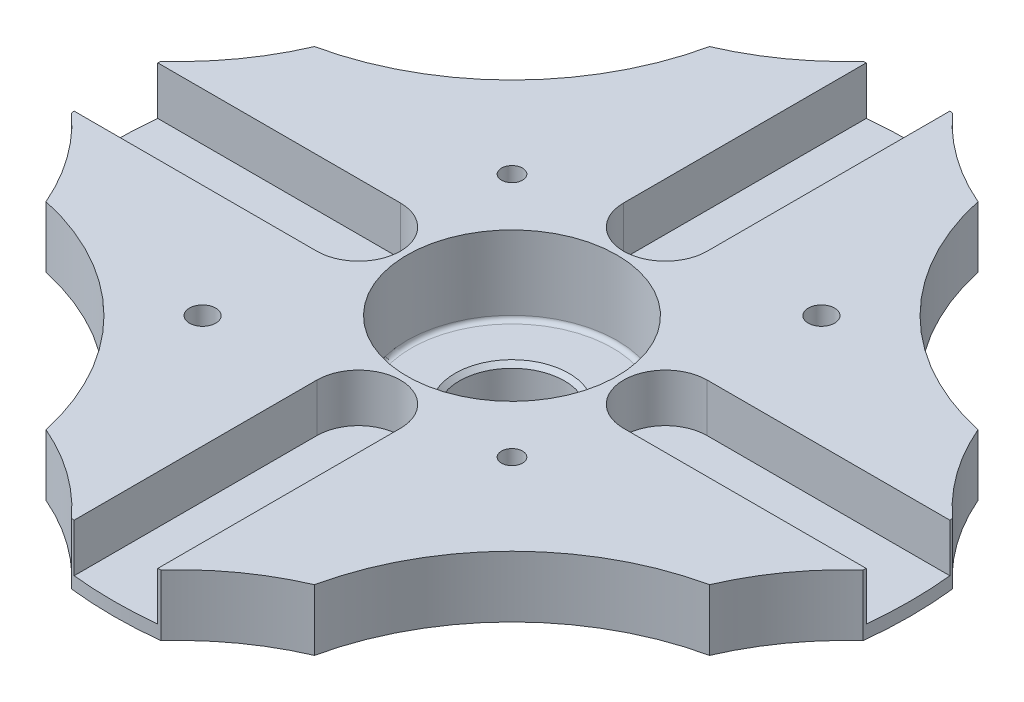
ISO-10303-21;
HEADER;
FILE_DESCRIPTION(('STEP AP214'),'2;1');
FILE_NAME('part.step','',(''),(''),'','','');
FILE_SCHEMA(('AUTOMOTIVE_DESIGN { 1 0 10303 214 1 1 1 1 }'));
ENDSEC;
DATA;
#1=APPLICATION_CONTEXT('core data for automotive mechanical design processes');
#2=APPLICATION_PROTOCOL_DEFINITION('international standard','automotive_design',2000,#1);
#3=PRODUCT_CONTEXT('',#1,'mechanical');
#4=PRODUCT('Part','Part','',(#3));
#5=PRODUCT_RELATED_PRODUCT_CATEGORY('part','',(#4));
#6=PRODUCT_DEFINITION_FORMATION('','',#4);
#7=PRODUCT_DEFINITION_CONTEXT('part definition',#1,'design');
#8=PRODUCT_DEFINITION('design','',#6,#7);
#9=PRODUCT_DEFINITION_SHAPE('','',#8);
#10=(LENGTH_UNIT() NAMED_UNIT(*) SI_UNIT(.MILLI.,.METRE.));
#11=(NAMED_UNIT(*) PLANE_ANGLE_UNIT() SI_UNIT($,.RADIAN.));
#12=(NAMED_UNIT(*) SI_UNIT($,.STERADIAN.) SOLID_ANGLE_UNIT());
#13=UNCERTAINTY_MEASURE_WITH_UNIT(LENGTH_MEASURE(1.E-05),#10,'distance_accuracy_value','');
#14=(GEOMETRIC_REPRESENTATION_CONTEXT(3) GLOBAL_UNCERTAINTY_ASSIGNED_CONTEXT((#13)) GLOBAL_UNIT_ASSIGNED_CONTEXT((#10,
#11,#12)) REPRESENTATION_CONTEXT('',''));
#15=CARTESIAN_POINT('',(0.,0.,0.));
#16=DIRECTION('',(0.,0.,1.));
#17=DIRECTION('',(1.,0.,0.));
#18=AXIS2_PLACEMENT_3D('',#15,#16,#17);
#19=CARTESIAN_POINT('',(-88.3699999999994,-0.001000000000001,88.3700000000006));
#20=DIRECTION('',(0.,1.,0.));
#21=DIRECTION('',(0.,0.,-1.));
#22=AXIS2_PLACEMENT_3D('',#19,#20,#21);
#23=CYLINDRICAL_SURFACE('',#22,59.05);
#24=DIRECTION('',(0.,1.,0.));
#25=VECTOR('',#24,1.);
#26=CARTESIAN_POINT('',(-30.6716926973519,-0.001000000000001,75.8078411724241));
#27=LINE('',#26,#25);
#28=CARTESIAN_POINT('',(-30.6716926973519,31.9,75.8078411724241));
#29=VERTEX_POINT('',#28);
#30=CARTESIAN_POINT('',(-30.6716926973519,45.9,75.8078411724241));
#31=VERTEX_POINT('',#30);
#32=EDGE_CURVE('E574',#29,#31,#27,.T.);
#33=ORIENTED_EDGE('',*,*,#32,.T.);
#34=CARTESIAN_POINT('',(-88.3699999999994,45.9,88.3700000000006));
#35=DIRECTION('',(0.,1.,0.));
#36=DIRECTION('',(0.,0.,-1.));
#37=AXIS2_PLACEMENT_3D('',#34,#35,#36);
#38=CIRCLE('',#37,59.05);
#39=CARTESIAN_POINT('',(-75.8078411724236,45.9,30.671692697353));
#40=VERTEX_POINT('',#39);
#41=EDGE_CURVE('E578',#31,#40,#38,.T.);
#42=ORIENTED_EDGE('',*,*,#41,.T.);
#43=DIRECTION('',(0.,1.,0.));
#44=VECTOR('',#43,1.);
#45=CARTESIAN_POINT('',(-75.8078411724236,-0.001000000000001,30.671692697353));
#46=LINE('',#45,#44);
#47=CARTESIAN_POINT('',(-75.8078411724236,31.9,30.671692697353));
#48=VERTEX_POINT('',#47);
#49=EDGE_CURVE('E580',#48,#40,#46,.T.);
#50=ORIENTED_EDGE('',*,*,#49,.F.);
#51=CARTESIAN_POINT('',(-88.3699999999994,31.9,88.3700000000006));
#52=DIRECTION('',(0.,-1.,0.));
#53=DIRECTION('',(0.,0.,1.));
#54=AXIS2_PLACEMENT_3D('',#51,#52,#53);
#55=CIRCLE('',#54,59.05);
#56=EDGE_CURVE('E583',#29,#48,#55,.F.);
#57=ORIENTED_EDGE('',*,*,#56,.F.);
#58=EDGE_LOOP('',(#33,#42,#50,#57));
#59=FACE_BOUND('',#58,.T.);
#60=CARTESIAN_POINT('',(-45.4993041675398,38.8999999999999,47.7620458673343));
#61=CARTESIAN_POINT('',(-45.4993067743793,38.9898550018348,47.762042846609));
#62=CARTESIAN_POINT('',(-45.5045278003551,39.0797747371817,47.7565289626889));
#63=CARTESIAN_POINT('',(-45.5252946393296,39.2571365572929,47.7346220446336));
#64=CARTESIAN_POINT('',(-45.5408528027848,39.3445755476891,47.7182159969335));
#65=CARTESIAN_POINT('',(-45.5818858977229,39.5143807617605,47.6750288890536));
#66=CARTESIAN_POINT('',(-45.6073559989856,39.5967494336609,47.6482528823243));
#67=CARTESIAN_POINT('',(-45.667538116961,39.75409276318,47.5851481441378));
#68=CARTESIAN_POINT('',(-45.7022478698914,39.8290692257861,47.5488217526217));
#69=CARTESIAN_POINT('',(-45.7800085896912,39.9695528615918,47.4676983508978));
#70=CARTESIAN_POINT('',(-45.8230623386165,40.0350568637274,47.4228985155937));
#71=CARTESIAN_POINT('',(-45.91635803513,40.154709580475,47.3261784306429));
#72=CARTESIAN_POINT('',(-45.9666002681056,40.2088578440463,47.2742578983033));
#73=CARTESIAN_POINT('',(-46.0729247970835,40.304265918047,47.1648335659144));
#74=CARTESIAN_POINT('',(-46.1290078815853,40.345523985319,47.1073290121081));
#75=CARTESIAN_POINT('',(-46.245476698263,40.4139690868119,46.9884346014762));
#76=CARTESIAN_POINT('',(-46.3058624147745,40.4411561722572,46.9270447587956));
#77=CARTESIAN_POINT('',(-46.429248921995,40.4806811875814,46.8021807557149));
#78=CARTESIAN_POINT('',(-46.4922490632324,40.4930227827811,46.7387071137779));
#79=CARTESIAN_POINT('',(-46.6191090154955,40.5025177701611,46.6114838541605));
#80=CARTESIAN_POINT('',(-46.6829688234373,40.4996712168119,46.5477342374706));
#81=CARTESIAN_POINT('',(-46.8097130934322,40.4788738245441,46.4217815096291));
#82=CARTESIAN_POINT('',(-46.8725978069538,40.4609269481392,46.3595779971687));
#83=CARTESIAN_POINT('',(-46.9955958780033,40.4104444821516,46.2384365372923));
#84=CARTESIAN_POINT('',(-47.0557092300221,40.3779088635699,46.1794985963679));
#85=CARTESIAN_POINT('',(-47.1714177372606,40.2991679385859,46.0665028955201));
#86=CARTESIAN_POINT('',(-47.2270122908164,40.2529608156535,46.0124457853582));
#87=CARTESIAN_POINT('',(-47.3320333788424,40.1481898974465,45.9106882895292));
#88=CARTESIAN_POINT('',(-47.3814599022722,40.0896260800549,45.86298791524));
#89=CARTESIAN_POINT('',(-47.4726857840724,39.9617817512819,45.7752091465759));
#90=CARTESIAN_POINT('',(-47.5144826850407,39.8924978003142,45.7351332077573));
#91=CARTESIAN_POINT('',(-47.5891710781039,39.7451920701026,45.6636869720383));
#92=CARTESIAN_POINT('',(-47.6220625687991,39.6671702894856,45.632316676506));
#93=CARTESIAN_POINT('',(-47.6779420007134,39.5046017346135,45.5791083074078));
#94=CARTESIAN_POINT('',(-47.7009298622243,39.4200549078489,45.5572703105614));
#95=CARTESIAN_POINT('',(-47.7362993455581,39.2468371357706,45.5236994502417));
#96=CARTESIAN_POINT('',(-47.748680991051,39.1581661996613,45.5119665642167));
#97=CARTESIAN_POINT('',(-47.7624560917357,38.9792474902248,45.4989145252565));
#98=CARTESIAN_POINT('',(-47.7638530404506,38.8890002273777,45.4975920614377));
#99=CARTESIAN_POINT('',(-47.7556250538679,38.7094641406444,45.5053866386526));
#100=CARTESIAN_POINT('',(-47.7460001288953,38.6201753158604,45.5145036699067));
#101=CARTESIAN_POINT('',(-47.7160259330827,38.4451041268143,45.5429371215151));
#102=CARTESIAN_POINT('',(-47.6956782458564,38.3593212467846,45.5622520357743));
#103=CARTESIAN_POINT('',(-47.6448812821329,38.1936812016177,45.6105749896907));
#104=CARTESIAN_POINT('',(-47.6144319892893,38.1138240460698,45.6395830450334));
#105=CARTESIAN_POINT('',(-47.5443479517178,37.962280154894,45.7065381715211));
#106=CARTESIAN_POINT('',(-47.504710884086,37.8905954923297,45.7444875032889));
#107=CARTESIAN_POINT('',(-47.4174511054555,37.7574522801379,45.8283158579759));
#108=CARTESIAN_POINT('',(-47.3698283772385,37.6959937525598,45.8741948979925));
#109=CARTESIAN_POINT('',(-47.2680078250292,37.5850313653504,45.9726681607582));
#110=CARTESIAN_POINT('',(-47.2138082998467,37.5355306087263,46.0252641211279));
#111=CARTESIAN_POINT('',(-47.1004493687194,37.4499101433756,46.135737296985));
#112=CARTESIAN_POINT('',(-47.0412899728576,37.4137904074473,46.1936145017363));
#113=CARTESIAN_POINT('',(-46.9197530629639,37.3559627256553,46.3130531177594));
#114=CARTESIAN_POINT('',(-46.8573759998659,37.3342527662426,46.3746140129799));
#115=CARTESIAN_POINT('',(-46.7312018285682,37.3058542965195,46.4997136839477));
#116=CARTESIAN_POINT('',(-46.6674047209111,37.2991657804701,46.5632524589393));
#117=CARTESIAN_POINT('',(-46.540234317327,37.3010003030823,46.6904931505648));
#118=CARTESIAN_POINT('',(-46.4768608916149,37.3095184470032,46.754195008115));
#119=CARTESIAN_POINT('',(-46.3523022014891,37.3415144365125,46.8799601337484));
#120=CARTESIAN_POINT('',(-46.2911169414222,37.3649923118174,46.9420233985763));
#121=CARTESIAN_POINT('',(-46.1726329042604,37.4262407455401,47.0627141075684));
#122=CARTESIAN_POINT('',(-46.1153341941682,37.4640115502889,47.1213414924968));
#123=CARTESIAN_POINT('',(-46.006195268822,37.5527716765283,47.2334386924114));
#124=CARTESIAN_POINT('',(-45.9543548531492,37.6037605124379,47.2869086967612));
#125=CARTESIAN_POINT('',(-45.8575202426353,37.7175225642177,47.3871202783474));
#126=CARTESIAN_POINT('',(-45.8125275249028,37.7802983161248,47.4338604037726));
#127=CARTESIAN_POINT('',(-45.7305933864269,37.9158668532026,47.5192103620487));
#128=CARTESIAN_POINT('',(-45.6936539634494,37.9886621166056,47.5578181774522));
#129=CARTESIAN_POINT('',(-45.6287995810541,38.1422288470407,47.6257427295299));
#130=CARTESIAN_POINT('',(-45.6008902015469,38.2230052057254,47.6550537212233));
#131=CARTESIAN_POINT('',(-45.5548863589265,38.3901445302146,47.7034330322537));
#132=CARTESIAN_POINT('',(-45.5367801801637,38.476500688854,47.7225135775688));
#133=CARTESIAN_POINT('',(-45.5156578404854,38.6195027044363,47.7447863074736));
#134=CARTESIAN_POINT('',(-45.5095323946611,38.6752201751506,47.7512499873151));
#135=CARTESIAN_POINT('',(-45.5013547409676,38.7872832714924,47.7598807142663));
#136=CARTESIAN_POINT('',(-45.4993025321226,38.8436288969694,47.7620477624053));
#137=CARTESIAN_POINT('',(-45.4993041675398,38.8999999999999,47.7620458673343));
#138=B_SPLINE_CURVE_WITH_KNOTS('',3,(#60,#61,#62,#63,#64,#65,#66,#67,#68,#69,#70,#71,#72,#73,
#74,#75,#76,#77,#78,#79,#80,#81,#82,#83,#84,#85,#86,#87,#88,#89,#90,#91,#92,#93,#94,#95,#96,#97,
#98,#99,#100,#101,#102,#103,#104,#105,#106,#107,#108,#109,#110,#111,#112,#113,#114,#115,#116,
#117,#118,#119,#120,#121,#122,#123,#124,#125,#126,#127,#128,#129,#130,#131,#132,#133,#134,#135,
#136,#137),.UNSPECIFIED.,.T.,.F.,(4,2,2,2,2,2,2,2,2,2,2,2,2,2,2,2,2,2,2,2,2,2,2,2,2,2,2,2,2,2,2,
2,2,2,2,2,2,2,4),(0.,0.269359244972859,0.53904089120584,0.808591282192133,1.07807569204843,
1.34765010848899,1.61723523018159,1.88685679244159,2.15647737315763,2.42603137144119,
2.69558440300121,2.96506672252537,3.23454957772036,3.50406825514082,3.77358741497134,
4.04319323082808,4.31279908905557,4.58240711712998,4.85201454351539,5.12153622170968,
5.39105764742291,5.66053927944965,5.93002134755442,6.19957162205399,6.46912247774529,
6.73874320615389,7.00836338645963,7.27794588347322,7.5475282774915,7.81702391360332,
8.08652008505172,8.3560209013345,8.62551181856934,8.89506078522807,9.16467654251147,
9.43445858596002,9.70391750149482,9.87290176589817,10.0418859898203),.UNSPECIFIED.);
#139=CARTESIAN_POINT('',(-45.4993041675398,38.8999999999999,47.7620458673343));
#140=VERTEX_POINT('',#139);
#141=EDGE_CURVE('E383',#140,#140,#138,.T.);
#142=ORIENTED_EDGE('',*,*,#141,.F.);
#143=EDGE_LOOP('',(#142));
#144=FACE_BOUND('',#143,.T.);
#145=ADVANCED_FACE('F44',(#59,#144),#23,.F.);
#146=CARTESIAN_POINT('',(-35.3499999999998,-0.001000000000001,35.3500000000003));
#147=DIRECTION('',(0.,1.,0.));
#148=DIRECTION('',(0.,0.,-1.));
#149=AXIS2_PLACEMENT_3D('',#146,#147,#148);
#150=CYLINDRICAL_SURFACE('',#149,3.);
#151=CARTESIAN_POINT('',(-35.3499999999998,45.9,35.3500000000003));
#152=DIRECTION('',(0.,1.,0.));
#153=DIRECTION('',(0.,0.,-1.));
#154=AXIS2_PLACEMENT_3D('',#151,#152,#153);
#155=CIRCLE('',#154,3.);
#156=CARTESIAN_POINT('',(-35.3499999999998,45.9,32.3500000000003));
#157=VERTEX_POINT('',#156);
#158=EDGE_CURVE('E535',#157,#157,#155,.T.);
#159=ORIENTED_EDGE('',*,*,#158,.T.);
#160=EDGE_LOOP('',(#159));
#161=FACE_BOUND('',#160,.T.);
#162=CARTESIAN_POINT('',(-35.3499999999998,31.9,35.3500000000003));
#163=DIRECTION('',(0.,-1.,0.));
#164=DIRECTION('',(0.,0.,1.));
#165=AXIS2_PLACEMENT_3D('',#162,#163,#164);
#166=CIRCLE('',#165,3.);
#167=CARTESIAN_POINT('',(-35.3499999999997,31.9,38.3500000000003));
#168=VERTEX_POINT('',#167);
#169=EDGE_CURVE('E413',#168,#168,#166,.F.);
#170=ORIENTED_EDGE('',*,*,#169,.F.);
#171=EDGE_LOOP('',(#170));
#172=FACE_BOUND('',#171,.T.);
#173=CARTESIAN_POINT('',(-36.0130649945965,38.8999999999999,38.2758066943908));
#174=CARTESIAN_POINT('',(-36.013075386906,38.9824745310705,38.2758082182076));
#175=CARTESIAN_POINT('',(-36.020492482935,39.0650325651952,38.2741539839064));
#176=CARTESIAN_POINT('',(-36.0494670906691,39.2275416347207,38.26735358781));
#177=CARTESIAN_POINT('',(-36.0710503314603,39.3074876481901,38.2622010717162));
#178=CARTESIAN_POINT('',(-36.1263490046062,39.4621043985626,38.2479448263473));
#179=CARTESIAN_POINT('',(-36.1599927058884,39.5368032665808,38.2388643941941));
#180=CARTESIAN_POINT('',(-36.237237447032,39.6800484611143,38.2160821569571));
#181=CARTESIAN_POINT('',(-36.280840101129,39.748593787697,38.2023796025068));
#182=CARTESIAN_POINT('',(-36.3803985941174,39.8847297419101,38.1680317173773));
#183=CARTESIAN_POINT('',(-36.437132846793,39.951616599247,38.1468522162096));
#184=CARTESIAN_POINT('',(-36.5575055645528,40.0757598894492,38.0970304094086));
#185=CARTESIAN_POINT('',(-36.6211478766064,40.1330109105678,38.0683839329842));
#186=CARTESIAN_POINT('',(-36.7581747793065,40.2407200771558,38.0001598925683));
#187=CARTESIAN_POINT('',(-36.8319317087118,40.2902790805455,37.9598954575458));
#188=CARTESIAN_POINT('',(-36.9814814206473,40.3748040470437,37.8691062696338));
#189=CARTESIAN_POINT('',(-37.0572727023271,40.4097804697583,37.8185889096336));
#190=CARTESIAN_POINT('',(-37.2014943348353,40.4612467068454,37.7120664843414));
#191=CARTESIAN_POINT('',(-37.2700325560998,40.4789804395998,37.6568120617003));
#192=CARTESIAN_POINT('',(-37.4031102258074,40.4995889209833,37.5392013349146));
#193=CARTESIAN_POINT('',(-37.4676524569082,40.5024741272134,37.4768500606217));
#194=CARTESIAN_POINT('',(-37.5842776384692,40.4937037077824,37.3536194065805));
#195=CARTESIAN_POINT('',(-37.6369615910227,40.4834540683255,37.2932013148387));
#196=CARTESIAN_POINT('',(-37.7359441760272,40.4512696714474,37.1703012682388));
#197=CARTESIAN_POINT('',(-37.7822423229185,40.4293340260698,37.1078191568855));
#198=CARTESIAN_POINT('',(-37.8683684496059,40.3743469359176,36.9820855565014));
#199=CARTESIAN_POINT('',(-37.9081121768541,40.3411653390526,36.9188338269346));
#200=CARTESIAN_POINT('',(-37.9804416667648,40.2648549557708,36.7942889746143));
#201=CARTESIAN_POINT('',(-38.0130250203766,40.2217228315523,36.7329965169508));
#202=CARTESIAN_POINT('',(-38.0744486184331,40.121633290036,36.6080590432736));
#203=CARTESIAN_POINT('',(-38.1025517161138,40.0637066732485,36.5448278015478));
#204=CARTESIAN_POINT('',(-38.1513858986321,39.9382268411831,36.4253653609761));
#205=CARTESIAN_POINT('',(-38.1721099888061,39.8706645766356,36.3691408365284));
#206=CARTESIAN_POINT('',(-38.208555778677,39.7213472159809,36.2621941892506));
#207=CARTESIAN_POINT('',(-38.2237508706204,39.6388916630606,36.2122612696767));
#208=CARTESIAN_POINT('',(-38.2479236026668,39.4658428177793,36.1271818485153));
#209=CARTESIAN_POINT('',(-38.2569082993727,39.3752588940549,36.0920185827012));
#210=CARTESIAN_POINT('',(-38.2691929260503,39.1961542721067,36.0420481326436));
#211=CARTESIAN_POINT('',(-38.2728949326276,39.1080624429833,36.0258208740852));
#212=CARTESIAN_POINT('',(-38.2763868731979,38.9303556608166,36.010555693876));
#213=CARTESIAN_POINT('',(-38.2761806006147,38.8407422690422,36.0115011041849));
#214=CARTESIAN_POINT('',(-38.2721244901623,38.6752780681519,36.0291462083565));
#215=CARTESIAN_POINT('',(-38.2687614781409,38.5991781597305,36.0437399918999));
#216=CARTESIAN_POINT('',(-38.2587683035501,38.4503776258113,36.0845095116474));
#217=CARTESIAN_POINT('',(-38.2521368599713,38.3776783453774,36.1106897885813));
#218=CARTESIAN_POINT('',(-38.2347328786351,38.2340269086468,36.1742834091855));
#219=CARTESIAN_POINT('',(-38.2237899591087,38.163294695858,36.2121428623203));
#220=CARTESIAN_POINT('',(-38.1971079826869,38.0282031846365,36.2965380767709));
#221=CARTESIAN_POINT('',(-38.1813664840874,37.9638471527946,36.3430782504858));
#222=CARTESIAN_POINT('',(-38.141616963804,37.8334106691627,36.4502723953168));
#223=CARTESIAN_POINT('',(-38.1167332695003,37.7684704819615,36.5119954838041));
#224=CARTESIAN_POINT('',(-38.0586214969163,37.6493652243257,36.6416732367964));
#225=CARTESIAN_POINT('',(-38.0253892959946,37.5952055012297,36.7096309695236));
#226=CARTESIAN_POINT('',(-37.9482128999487,37.4971582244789,36.8520346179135));
#227=CARTESIAN_POINT('',(-37.9038809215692,37.4537911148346,36.9266328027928));
#228=CARTESIAN_POINT('',(-37.805098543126,37.3822759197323,37.0764149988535));
#229=CARTESIAN_POINT('',(-37.7506582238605,37.3541127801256,37.1515983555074));
#230=CARTESIAN_POINT('',(-37.6383886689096,37.3165182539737,37.2917857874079));
#231=CARTESIAN_POINT('',(-37.5814266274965,37.3055101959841,37.3570613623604));
#232=CARTESIAN_POINT('',(-37.4615553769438,37.2977144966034,37.4828066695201));
#233=CARTESIAN_POINT('',(-37.3986489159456,37.3009203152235,37.543278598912));
#234=CARTESIAN_POINT('',(-37.2744055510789,37.3205169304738,37.6528179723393));
#235=CARTESIAN_POINT('',(-37.2133553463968,37.3358169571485,37.7024126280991));
#236=CARTESIAN_POINT('',(-37.0900931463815,37.377562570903,37.7949990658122));
#237=CARTESIAN_POINT('',(-37.027881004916,37.4040095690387,37.8379900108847));
#238=CARTESIAN_POINT('',(-36.9019199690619,37.468268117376,37.9185299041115));
#239=CARTESIAN_POINT('',(-36.8382015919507,37.506470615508,37.9558125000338));
#240=CARTESIAN_POINT('',(-36.7136316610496,37.59267520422,38.0231123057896));
#241=CARTESIAN_POINT('',(-36.6527813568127,37.6406815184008,38.0531263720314));
#242=CARTESIAN_POINT('',(-36.5293901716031,37.7512263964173,38.1093706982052));
#243=CARTESIAN_POINT('',(-36.4674035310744,37.8147839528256,38.1348180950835));
#244=CARTESIAN_POINT('',(-36.3518710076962,37.9514912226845,38.1784408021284));
#245=CARTESIAN_POINT('',(-36.2983344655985,38.0246513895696,38.1966080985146));
#246=CARTESIAN_POINT('',(-36.2000282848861,38.1834571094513,38.227542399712));
#247=CARTESIAN_POINT('',(-36.1558872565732,38.2695632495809,38.2399652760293));
#248=CARTESIAN_POINT('',(-36.0840039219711,38.448829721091,38.2590635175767));
#249=CARTESIAN_POINT('',(-36.0562080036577,38.5419658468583,38.2657577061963));
#250=CARTESIAN_POINT('',(-36.0298082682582,38.6802480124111,38.2719721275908));
#251=CARTESIAN_POINT('',(-36.0235497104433,38.7239408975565,38.273413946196));
#252=CARTESIAN_POINT('',(-36.0151752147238,38.8117478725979,38.2753308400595));
#253=CARTESIAN_POINT('',(-36.0130594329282,38.8558619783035,38.2758058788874));
#254=CARTESIAN_POINT('',(-36.0130649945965,38.8999999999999,38.2758066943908));
#255=B_SPLINE_CURVE_WITH_KNOTS('',3,(#173,#174,#175,#176,#177,#178,#179,#180,#181,#182,#183,
#184,#185,#186,#187,#188,#189,#190,#191,#192,#193,#194,#195,#196,#197,#198,#199,#200,#201,#202,
#203,#204,#205,#206,#207,#208,#209,#210,#211,#212,#213,#214,#215,#216,#217,#218,#219,#220,#221,
#222,#223,#224,#225,#226,#227,#228,#229,#230,#231,#232,#233,#234,#235,#236,#237,#238,#239,#240,
#241,#242,#243,#244,#245,#246,#247,#248,#249,#250,#251,#252,#253,#254),.UNSPECIFIED.,.T.,.F.,(4,
2,2,2,2,2,2,2,2,2,2,2,2,2,2,2,2,2,2,2,2,2,2,2,2,2,2,2,2,2,2,2,2,2,2,2,2,2,2,2,4),(0.,
0.24723694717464,0.494924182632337,0.741162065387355,0.987439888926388,1.25701617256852,
1.52674335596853,1.81786745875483,2.10878238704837,2.37667542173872,2.64437975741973,
2.88568250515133,3.12700359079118,3.37121873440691,3.61551591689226,3.88511401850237,
4.15496699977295,4.44620613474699,4.73711380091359,5.00441947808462,5.27146571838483,
5.5030971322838,5.73481940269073,5.97680341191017,6.21891075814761,6.49665128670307,
6.77452923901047,7.06395553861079,7.35309473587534,7.61364749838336,7.87408038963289,
8.11338489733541,8.35271970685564,8.6010798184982,8.84954715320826,9.12542892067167,
9.40161354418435,9.69269476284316,9.98281583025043,10.1151250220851,10.2474391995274),.UNSPECIFIED.);
#256=CARTESIAN_POINT('',(-36.0130649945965,38.8999999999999,38.2758066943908));
#257=VERTEX_POINT('',#256);
#258=EDGE_CURVE('E391',#257,#257,#255,.T.);
#259=ORIENTED_EDGE('',*,*,#258,.T.);
#260=EDGE_LOOP('',(#259));
#261=FACE_BOUND('',#260,.T.);
#262=ADVANCED_FACE('F364',(#161,#172,#261),#150,.F.);
#263=CARTESIAN_POINT('',(88.37,-0.001000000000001,-88.37));
#264=DIRECTION('',(0.,1.,0.));
#265=DIRECTION('',(0.,0.,1.));
#266=AXIS2_PLACEMENT_3D('',#263,#264,#265);
#267=CYLINDRICAL_SURFACE('',#266,59.05);
#268=DIRECTION('',(0.,1.,0.));
#269=VECTOR('',#268,1.);
#270=CARTESIAN_POINT('',(30.6716926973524,-0.001000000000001,-75.8078411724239));
#271=LINE('',#270,#269);
#272=CARTESIAN_POINT('',(30.6716926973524,31.9,-75.8078411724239));
#273=VERTEX_POINT('',#272);
#274=CARTESIAN_POINT('',(30.6716926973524,45.9,-75.8078411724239));
#275=VERTEX_POINT('',#274);
#276=EDGE_CURVE('E643',#273,#275,#271,.T.);
#277=ORIENTED_EDGE('',*,*,#276,.T.);
#278=CARTESIAN_POINT('',(88.37,45.9,-88.37));
#279=DIRECTION('',(0.,1.,0.));
#280=DIRECTION('',(0.,0.,1.));
#281=AXIS2_PLACEMENT_3D('',#278,#279,#280);
#282=CIRCLE('',#281,59.05);
#283=CARTESIAN_POINT('',(75.8078411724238,45.9,-30.6716926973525));
#284=VERTEX_POINT('',#283);
#285=EDGE_CURVE('E631',#275,#284,#282,.T.);
#286=ORIENTED_EDGE('',*,*,#285,.T.);
#287=DIRECTION('',(0.,1.,0.));
#288=VECTOR('',#287,1.);
#289=CARTESIAN_POINT('',(75.8078411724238,-0.001000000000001,-30.6716926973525));
#290=LINE('',#289,#288);
#291=CARTESIAN_POINT('',(75.8078411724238,31.9,-30.6716926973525));
#292=VERTEX_POINT('',#291);
#293=EDGE_CURVE('E641',#292,#284,#290,.T.);
#294=ORIENTED_EDGE('',*,*,#293,.F.);
#295=CARTESIAN_POINT('',(88.37,31.9,-88.37));
#296=DIRECTION('',(0.,-1.,0.));
#297=DIRECTION('',(0.,0.,-1.));
#298=AXIS2_PLACEMENT_3D('',#295,#296,#297);
#299=CIRCLE('',#298,59.05);
#300=EDGE_CURVE('E623',#273,#292,#299,.F.);
#301=ORIENTED_EDGE('',*,*,#300,.F.);
#302=EDGE_LOOP('',(#277,#286,#294,#301));
#303=FACE_BOUND('',#302,.T.);
#304=CARTESIAN_POINT('',(45.4993041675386,38.9,-47.7620458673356));
#305=CARTESIAN_POINT('',(45.4993067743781,38.9898550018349,-47.7620428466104));
#306=CARTESIAN_POINT('',(45.5045278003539,39.0797747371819,-47.7565289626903));
#307=CARTESIAN_POINT('',(45.5252946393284,39.2571365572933,-47.7346220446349));
#308=CARTESIAN_POINT('',(45.5408528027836,39.3445755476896,-47.7182159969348));
#309=CARTESIAN_POINT('',(45.5818858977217,39.5143807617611,-47.6750288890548));
#310=CARTESIAN_POINT('',(45.6073559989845,39.5967494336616,-47.6482528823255));
#311=CARTESIAN_POINT('',(45.6675381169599,39.7540927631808,-47.585148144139));
#312=CARTESIAN_POINT('',(45.7022478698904,39.8290692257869,-47.5488217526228));
#313=CARTESIAN_POINT('',(45.7800085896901,39.9695528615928,-47.4676983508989));
#314=CARTESIAN_POINT('',(45.8230623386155,40.0350568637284,-47.4228985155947));
#315=CARTESIAN_POINT('',(45.9163580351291,40.1547095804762,-47.3261784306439));
#316=CARTESIAN_POINT('',(45.9666002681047,40.2088578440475,-47.2742578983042));
#317=CARTESIAN_POINT('',(46.0729247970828,40.3042659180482,-47.1648335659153));
#318=CARTESIAN_POINT('',(46.1290078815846,40.3455239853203,-47.1073290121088));
#319=CARTESIAN_POINT('',(46.2454766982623,40.4139690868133,-46.9884346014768));
#320=CARTESIAN_POINT('',(46.3058624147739,40.4411561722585,-46.9270447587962));
#321=CARTESIAN_POINT('',(46.4292489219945,40.4806811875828,-46.8021807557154));
#322=CARTESIAN_POINT('',(46.492249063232,40.4930227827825,-46.7387071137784));
#323=CARTESIAN_POINT('',(46.6191090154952,40.5025177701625,-46.6114838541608));
#324=CARTESIAN_POINT('',(46.682968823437,40.4996712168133,-46.5477342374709));
#325=CARTESIAN_POINT('',(46.809713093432,40.4788738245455,-46.4217815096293));
#326=CARTESIAN_POINT('',(46.8725978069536,40.4609269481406,-46.3595779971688));
#327=CARTESIAN_POINT('',(46.9955958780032,40.4104444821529,-46.2384365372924));
#328=CARTESIAN_POINT('',(47.0557092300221,40.3779088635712,-46.1794985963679));
#329=CARTESIAN_POINT('',(47.1714177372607,40.2991679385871,-46.06650289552));
#330=CARTESIAN_POINT('',(47.2270122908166,40.2529608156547,-46.0124457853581));
#331=CARTESIAN_POINT('',(47.3320333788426,40.1481898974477,-45.9106882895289));
#332=CARTESIAN_POINT('',(47.3814599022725,40.089626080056,-45.8629879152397));
#333=CARTESIAN_POINT('',(47.4726857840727,39.9617817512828,-45.7752091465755));
#334=CARTESIAN_POINT('',(47.5144826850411,39.8924978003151,-45.7351332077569));
#335=CARTESIAN_POINT('',(47.5891710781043,39.7451920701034,-45.6636869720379));
#336=CARTESIAN_POINT('',(47.6220625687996,39.6671702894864,-45.6323166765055));
#337=CARTESIAN_POINT('',(47.6779420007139,39.5046017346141,-45.5791083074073));
#338=CARTESIAN_POINT('',(47.7009298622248,39.4200549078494,-45.5572703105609));
#339=CARTESIAN_POINT('',(47.7362993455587,39.246837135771,-45.5236994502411));
#340=CARTESIAN_POINT('',(47.7486809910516,39.1581661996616,-45.5119665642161));
#341=CARTESIAN_POINT('',(47.7624560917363,38.979247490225,-45.4989145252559));
#342=CARTESIAN_POINT('',(47.7638530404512,38.8890002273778,-45.4975920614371));
#343=CARTESIAN_POINT('',(47.7556250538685,38.7094641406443,-45.505386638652));
#344=CARTESIAN_POINT('',(47.7460001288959,38.6201753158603,-45.5145036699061));
#345=CARTESIAN_POINT('',(47.7160259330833,38.445104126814,-45.5429371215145));
#346=CARTESIAN_POINT('',(47.6956782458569,38.3593212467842,-45.5622520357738));
#347=CARTESIAN_POINT('',(47.6448812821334,38.1936812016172,-45.6105749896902));
#348=CARTESIAN_POINT('',(47.6144319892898,38.1138240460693,-45.6395830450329));
#349=CARTESIAN_POINT('',(47.5443479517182,37.9622801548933,-45.7065381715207));
#350=CARTESIAN_POINT('',(47.5047108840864,37.8905954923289,-45.7444875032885));
#351=CARTESIAN_POINT('',(47.4174511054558,37.757452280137,-45.8283158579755));
#352=CARTESIAN_POINT('',(47.3698283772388,37.6959937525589,-45.8741948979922));
#353=CARTESIAN_POINT('',(47.2680078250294,37.5850313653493,-45.972668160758));
#354=CARTESIAN_POINT('',(47.2138082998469,37.5355306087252,-46.0252641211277));
#355=CARTESIAN_POINT('',(47.1004493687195,37.4499101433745,-46.1357372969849));
#356=CARTESIAN_POINT('',(47.0412899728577,37.4137904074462,-46.1936145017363));
#357=CARTESIAN_POINT('',(46.9197530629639,37.3559627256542,-46.3130531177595));
#358=CARTESIAN_POINT('',(46.8573759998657,37.3342527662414,-46.37461401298));
#359=CARTESIAN_POINT('',(46.731201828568,37.3058542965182,-46.4997136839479));
#360=CARTESIAN_POINT('',(46.6674047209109,37.2991657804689,-46.5632524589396));
#361=CARTESIAN_POINT('',(46.5402343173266,37.3010003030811,-46.6904931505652));
#362=CARTESIAN_POINT('',(46.4768608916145,37.3095184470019,-46.7541950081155));
#363=CARTESIAN_POINT('',(46.3523022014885,37.3415144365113,-46.879960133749));
#364=CARTESIAN_POINT('',(46.2911169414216,37.3649923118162,-46.9420233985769));
#365=CARTESIAN_POINT('',(46.1726329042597,37.426240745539,-47.0627141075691));
#366=CARTESIAN_POINT('',(46.1153341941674,37.4640115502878,-47.1213414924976));
#367=CARTESIAN_POINT('',(46.0061952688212,37.5527716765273,-47.2334386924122));
#368=CARTESIAN_POINT('',(45.9543548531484,37.6037605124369,-47.2869086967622));
#369=CARTESIAN_POINT('',(45.8575202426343,37.7175225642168,-47.3871202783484));
#370=CARTESIAN_POINT('',(45.8125275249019,37.780298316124,-47.4338604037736));
#371=CARTESIAN_POINT('',(45.7305933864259,37.9158668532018,-47.5192103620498));
#372=CARTESIAN_POINT('',(45.6936539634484,37.9886621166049,-47.5578181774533));
#373=CARTESIAN_POINT('',(45.628799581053,38.1422288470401,-47.6257427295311));
#374=CARTESIAN_POINT('',(45.6008902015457,38.2230052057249,-47.6550537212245));
#375=CARTESIAN_POINT('',(45.5548863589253,38.3901445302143,-47.703433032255));
#376=CARTESIAN_POINT('',(45.5367801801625,38.4765006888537,-47.7225135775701));
#377=CARTESIAN_POINT('',(45.5156578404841,38.6195027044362,-47.7447863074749));
#378=CARTESIAN_POINT('',(45.5095323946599,38.6752201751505,-47.7512499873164));
#379=CARTESIAN_POINT('',(45.5013547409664,38.7872832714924,-47.7598807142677));
#380=CARTESIAN_POINT('',(45.4993025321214,38.8436288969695,-47.7620477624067));
#381=CARTESIAN_POINT('',(45.4993041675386,38.9,-47.7620458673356));
#382=B_SPLINE_CURVE_WITH_KNOTS('',3,(#304,#305,#306,#307,#308,#309,#310,#311,#312,#313,#314,
#315,#316,#317,#318,#319,#320,#321,#322,#323,#324,#325,#326,#327,#328,#329,#330,#331,#332,#333,
#334,#335,#336,#337,#338,#339,#340,#341,#342,#343,#344,#345,#346,#347,#348,#349,#350,#351,#352,
#353,#354,#355,#356,#357,#358,#359,#360,#361,#362,#363,#364,#365,#366,#367,#368,#369,#370,#371,
#372,#373,#374,#375,#376,#377,#378,#379,#380,#381),.UNSPECIFIED.,.T.,.F.,(4,2,2,2,2,2,2,2,2,2,2,
2,2,2,2,2,2,2,2,2,2,2,2,2,2,2,2,2,2,2,2,2,2,2,2,2,2,2,4),(0.,0.269359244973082,
0.539040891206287,0.808591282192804,1.07807569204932,1.3476501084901,1.61723523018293,
1.88685679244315,2.15647737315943,2.4260313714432,2.69558440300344,2.96506672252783,
3.23454957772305,3.50406825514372,3.77358741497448,4.04319323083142,4.31279908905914,
4.58240711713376,4.85201454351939,5.12153622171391,5.39105764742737,5.66053927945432,
5.93002134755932,6.19957162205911,6.46912247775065,6.73874320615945,7.00836338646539,
7.27794588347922,7.54752827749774,7.8170239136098,8.08652008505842,8.35602090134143,
8.6255118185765,8.89506078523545,9.16467654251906,9.43445858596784,9.70391750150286,
9.87290176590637,10.0418859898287),.UNSPECIFIED.);
#383=CARTESIAN_POINT('',(45.4993041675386,38.9,-47.7620458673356));
#384=VERTEX_POINT('',#383);
#385=EDGE_CURVE('E407',#384,#384,#382,.T.);
#386=ORIENTED_EDGE('',*,*,#385,.F.);
#387=EDGE_LOOP('',(#386));
#388=FACE_BOUND('',#387,.T.);
#389=ADVANCED_FACE('F370',(#303,#388),#267,.F.);
#390=CARTESIAN_POINT('',(35.35,-0.001000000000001,-35.35));
#391=DIRECTION('',(0.,1.,0.));
#392=DIRECTION('',(0.,0.,1.));
#393=AXIS2_PLACEMENT_3D('',#390,#391,#392);
#394=CYLINDRICAL_SURFACE('',#393,3.);
#395=CARTESIAN_POINT('',(35.35,45.9,-35.35));
#396=DIRECTION('',(0.,1.,0.));
#397=DIRECTION('',(0.,0.,1.));
#398=AXIS2_PLACEMENT_3D('',#395,#396,#397);
#399=CIRCLE('',#398,3.);
#400=CARTESIAN_POINT('',(35.35,45.9,-32.35));
#401=VERTEX_POINT('',#400);
#402=EDGE_CURVE('E539',#401,#401,#399,.T.);
#403=ORIENTED_EDGE('',*,*,#402,.T.);
#404=EDGE_LOOP('',(#403));
#405=FACE_BOUND('',#404,.T.);
#406=CARTESIAN_POINT('',(35.35,31.9,-35.35));
#407=DIRECTION('',(0.,-1.,0.));
#408=DIRECTION('',(0.,0.,-1.));
#409=AXIS2_PLACEMENT_3D('',#406,#407,#408);
#410=CIRCLE('',#409,3.);
#411=CARTESIAN_POINT('',(35.35,31.9,-38.35));
#412=VERTEX_POINT('',#411);
#413=EDGE_CURVE('E833',#412,#412,#410,.F.);
#414=ORIENTED_EDGE('',*,*,#413,.F.);
#415=EDGE_LOOP('',(#414));
#416=FACE_BOUND('',#415,.T.);
#417=CARTESIAN_POINT('',(36.0130649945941,38.9,-38.2758066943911));
#418=CARTESIAN_POINT('',(36.0130753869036,38.9824745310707,-38.2758082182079));
#419=CARTESIAN_POINT('',(36.0204924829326,39.0650325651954,-38.2741539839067));
#420=CARTESIAN_POINT('',(36.0494670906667,39.227541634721,-38.2673535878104));
#421=CARTESIAN_POINT('',(36.071050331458,39.3074876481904,-38.2622010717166));
#422=CARTESIAN_POINT('',(36.126349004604,39.4621043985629,-38.2479448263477));
#423=CARTESIAN_POINT('',(36.1599927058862,39.5368032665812,-38.2388643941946));
#424=CARTESIAN_POINT('',(36.2372374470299,39.6800484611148,-38.2160821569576));
#425=CARTESIAN_POINT('',(36.2808401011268,39.7485937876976,-38.2023796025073));
#426=CARTESIAN_POINT('',(36.3803985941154,39.8847297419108,-38.1680317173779));
#427=CARTESIAN_POINT('',(36.437132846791,39.9516165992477,-38.1468522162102));
#428=CARTESIAN_POINT('',(36.557505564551,40.07575988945,-38.0970304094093));
#429=CARTESIAN_POINT('',(36.6211478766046,40.1330109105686,-38.0683839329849));
#430=CARTESIAN_POINT('',(36.7581747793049,40.2407200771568,-38.0001598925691));
#431=CARTESIAN_POINT('',(36.8319317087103,40.2902790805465,-37.9598954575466));
#432=CARTESIAN_POINT('',(36.981481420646,40.3748040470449,-37.8691062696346));
#433=CARTESIAN_POINT('',(37.0572727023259,40.4097804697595,-37.8185889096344));
#434=CARTESIAN_POINT('',(37.2014943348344,40.4612467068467,-37.7120664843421));
#435=CARTESIAN_POINT('',(37.2700325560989,40.4789804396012,-37.656812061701));
#436=CARTESIAN_POINT('',(37.4031102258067,40.4995889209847,-37.5392013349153));
#437=CARTESIAN_POINT('',(37.4676524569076,40.5024741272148,-37.4768500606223));
#438=CARTESIAN_POINT('',(37.5842776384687,40.4937037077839,-37.353619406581));
#439=CARTESIAN_POINT('',(37.6369615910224,40.4834540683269,-37.2932013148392));
#440=CARTESIAN_POINT('',(37.7359441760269,40.4512696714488,-37.1703012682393));
#441=CARTESIAN_POINT('',(37.7822423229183,40.4293340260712,-37.1078191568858));
#442=CARTESIAN_POINT('',(37.8683684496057,40.374346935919,-36.9820855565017));
#443=CARTESIAN_POINT('',(37.908112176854,40.341165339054,-36.9188338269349));
#444=CARTESIAN_POINT('',(37.9804416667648,40.2648549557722,-36.7942889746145));
#445=CARTESIAN_POINT('',(38.0130250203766,40.2217228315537,-36.732996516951));
#446=CARTESIAN_POINT('',(38.0744486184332,40.1216332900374,-36.6080590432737));
#447=CARTESIAN_POINT('',(38.102551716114,40.0637066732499,-36.5448278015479));
#448=CARTESIAN_POINT('',(38.1513858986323,39.9382268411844,-36.4253653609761));
#449=CARTESIAN_POINT('',(38.1721099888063,39.8706645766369,-36.3691408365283));
#450=CARTESIAN_POINT('',(38.2085557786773,39.7213472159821,-36.2621941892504));
#451=CARTESIAN_POINT('',(38.2237508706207,39.6388916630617,-36.2122612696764));
#452=CARTESIAN_POINT('',(38.2479236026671,39.4658428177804,-36.1271818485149));
#453=CARTESIAN_POINT('',(38.256908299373,39.3752588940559,-36.0920185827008));
#454=CARTESIAN_POINT('',(38.2691929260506,39.1961542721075,-36.042048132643));
#455=CARTESIAN_POINT('',(38.2728949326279,39.108062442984,-36.0258208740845));
#456=CARTESIAN_POINT('',(38.2763868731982,38.9303556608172,-36.0105556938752));
#457=CARTESIAN_POINT('',(38.276180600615,38.8407422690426,-36.0115011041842));
#458=CARTESIAN_POINT('',(38.2721244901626,38.6752780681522,-36.0291462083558));
#459=CARTESIAN_POINT('',(38.2687614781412,38.5991781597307,-36.0437399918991));
#460=CARTESIAN_POINT('',(38.2587683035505,38.4503776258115,-36.0845095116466));
#461=CARTESIAN_POINT('',(38.2521368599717,38.3776783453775,-36.1106897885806));
#462=CARTESIAN_POINT('',(38.2347328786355,38.2340269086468,-36.1742834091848));
#463=CARTESIAN_POINT('',(38.2237899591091,38.1632946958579,-36.2121428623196));
#464=CARTESIAN_POINT('',(38.1971079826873,38.0282031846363,-36.2965380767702));
#465=CARTESIAN_POINT('',(38.1813664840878,37.9638471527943,-36.3430782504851));
#466=CARTESIAN_POINT('',(38.1416169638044,37.8334106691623,-36.4502723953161));
#467=CARTESIAN_POINT('',(38.1167332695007,37.768470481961,-36.5119954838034));
#468=CARTESIAN_POINT('',(38.0586214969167,37.6493652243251,-36.6416732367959));
#469=CARTESIAN_POINT('',(38.025389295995,37.5952055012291,-36.7096309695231));
#470=CARTESIAN_POINT('',(37.948212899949,37.4971582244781,-36.852034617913));
#471=CARTESIAN_POINT('',(37.9038809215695,37.4537911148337,-36.9266328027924));
#472=CARTESIAN_POINT('',(37.8050985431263,37.3822759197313,-37.0764149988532));
#473=CARTESIAN_POINT('',(37.7506582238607,37.3541127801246,-37.1515983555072));
#474=CARTESIAN_POINT('',(37.6383886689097,37.3165182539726,-37.2917857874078));
#475=CARTESIAN_POINT('',(37.5814266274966,37.3055101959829,-37.3570613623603));
#476=CARTESIAN_POINT('',(37.4615553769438,37.2977144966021,-37.4828066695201));
#477=CARTESIAN_POINT('',(37.3986489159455,37.3009203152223,-37.5432785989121));
#478=CARTESIAN_POINT('',(37.2744055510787,37.3205169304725,-37.6528179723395));
#479=CARTESIAN_POINT('',(37.2133553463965,37.3358169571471,-37.7024126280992));
#480=CARTESIAN_POINT('',(37.0900931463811,37.3775625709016,-37.7949990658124));
#481=CARTESIAN_POINT('',(37.0278810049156,37.4040095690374,-37.8379900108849));
#482=CARTESIAN_POINT('',(36.9019199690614,37.4682681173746,-37.9185299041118));
#483=CARTESIAN_POINT('',(36.8382015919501,37.5064706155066,-37.955812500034));
#484=CARTESIAN_POINT('',(36.7136316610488,37.5926752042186,-38.0231123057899));
#485=CARTESIAN_POINT('',(36.6527813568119,37.6406815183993,-38.0531263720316));
#486=CARTESIAN_POINT('',(36.5293901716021,37.7512263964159,-38.1093706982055));
#487=CARTESIAN_POINT('',(36.4674035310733,37.8147839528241,-38.1348180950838));
#488=CARTESIAN_POINT('',(36.3518710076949,37.9514912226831,-38.1784408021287));
#489=CARTESIAN_POINT('',(36.2983344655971,38.0246513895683,-38.196608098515));
#490=CARTESIAN_POINT('',(36.2000282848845,38.18345710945,-38.2275423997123));
#491=CARTESIAN_POINT('',(36.1558872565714,38.2695632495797,-38.2399652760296));
#492=CARTESIAN_POINT('',(36.0840039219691,38.44882972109,-38.259063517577));
#493=CARTESIAN_POINT('',(36.0562080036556,38.5419658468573,-38.2657577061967));
#494=CARTESIAN_POINT('',(36.029808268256,38.6802480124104,-38.2719721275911));
#495=CARTESIAN_POINT('',(36.023549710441,38.7239408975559,-38.2734139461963));
#496=CARTESIAN_POINT('',(36.0151752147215,38.8117478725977,-38.2753308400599));
#497=CARTESIAN_POINT('',(36.0130594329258,38.8558619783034,-38.2758058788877));
#498=CARTESIAN_POINT('',(36.0130649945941,38.9,-38.2758066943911));
#499=B_SPLINE_CURVE_WITH_KNOTS('',3,(#417,#418,#419,#420,#421,#422,#423,#424,#425,#426,#427,
#428,#429,#430,#431,#432,#433,#434,#435,#436,#437,#438,#439,#440,#441,#442,#443,#444,#445,#446,
#447,#448,#449,#450,#451,#452,#453,#454,#455,#456,#457,#458,#459,#460,#461,#462,#463,#464,#465,
#466,#467,#468,#469,#470,#471,#472,#473,#474,#475,#476,#477,#478,#479,#480,#481,#482,#483,#484,
#485,#486,#487,#488,#489,#490,#491,#492,#493,#494,#495,#496,#497,#498),.UNSPECIFIED.,.T.,.F.,(4,
2,2,2,2,2,2,2,2,2,2,2,2,2,2,2,2,2,2,2,2,2,2,2,2,2,2,2,2,2,2,2,2,2,2,2,2,2,2,2,4),(0.,
0.247236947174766,0.494924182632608,0.74116206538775,0.987439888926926,1.25701617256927,
1.52674335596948,1.8178674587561,2.10878238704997,2.37667542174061,2.64437975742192,
2.8856825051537,3.12700359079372,3.37121873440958,3.61551591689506,3.88511401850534,
4.15496699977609,4.44620613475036,4.73711380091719,5.00441947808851,5.27146571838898,
5.50309713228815,5.73481940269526,5.97680341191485,6.21891075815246,6.49665128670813,
6.77452923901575,7.0639555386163,7.3530947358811,7.61364749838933,7.87408038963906,
8.11338489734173,8.35271970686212,8.60107981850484,8.84954715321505,9.12542892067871,
9.40161354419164,9.69269476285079,9.98281583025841,10.1151250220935,10.2474391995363),.UNSPECIFIED.);
#500=CARTESIAN_POINT('',(36.0130649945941,38.9,-38.2758066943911));
#501=VERTEX_POINT('',#500);
#502=EDGE_CURVE('E390',#501,#501,#499,.T.);
#503=ORIENTED_EDGE('',*,*,#502,.T.);
#504=EDGE_LOOP('',(#503));
#505=FACE_BOUND('',#504,.T.);
#506=ADVANCED_FACE('F419',(#405,#416,#505),#394,.F.);
#507=CARTESIAN_POINT('',(0.,0.,0.));
#508=DIRECTION('',(0.,-1.,0.));
#509=DIRECTION('',(0.,0.,-1.));
#510=AXIS2_PLACEMENT_3D('',#507,#508,#509);
#511=CYLINDRICAL_SURFACE('',#510,91.);
#512=DIRECTION('',(0.,1.,0.));
#513=VECTOR('',#512,1.);
#514=CARTESIAN_POINT('',(10.2445041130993,-0.001000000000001,90.4215136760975));
#515=LINE('',#514,#513);
#516=CARTESIAN_POINT('',(10.2445041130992,31.9,90.4215136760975));
#517=VERTEX_POINT('',#516);
#518=CARTESIAN_POINT('',(10.2445041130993,45.9,90.4215136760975));
#519=VERTEX_POINT('',#518);
#520=EDGE_CURVE('E565',#517,#519,#515,.T.);
#521=ORIENTED_EDGE('',*,*,#520,.T.);
#522=CARTESIAN_POINT('',(0.,45.9,0.));
#523=DIRECTION('',(0.,-1.,0.));
#524=DIRECTION('',(0.,0.,-1.));
#525=AXIS2_PLACEMENT_3D('',#522,#523,#524);
#526=CIRCLE('',#525,91.);
#527=CARTESIAN_POINT('',(9.55000000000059,45.9,90.4974999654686));
#528=VERTEX_POINT('',#527);
#529=EDGE_CURVE('E280',#519,#528,#526,.T.);
#530=ORIENTED_EDGE('',*,*,#529,.T.);
#531=DIRECTION('',(0.,1.,0.));
#532=VECTOR('',#531,1.);
#533=CARTESIAN_POINT('',(9.55000000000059,34.9,90.4974999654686));
#534=LINE('',#533,#532);
#535=CARTESIAN_POINT('',(9.55000000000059,34.9,90.4974999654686));
#536=VERTEX_POINT('',#535);
#537=EDGE_CURVE('E697',#536,#528,#534,.T.);
#538=ORIENTED_EDGE('',*,*,#537,.F.);
#539=CARTESIAN_POINT('',(0.,34.9,0.));
#540=DIRECTION('',(0.,1.,0.));
#541=DIRECTION('',(0.,0.,-1.));
#542=AXIS2_PLACEMENT_3D('',#539,#540,#541);
#543=CIRCLE('',#542,91.);
#544=CARTESIAN_POINT('',(-9.54999999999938,34.9,90.4974999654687));
#545=VERTEX_POINT('',#544);
#546=EDGE_CURVE('E673',#545,#536,#543,.T.);
#547=ORIENTED_EDGE('',*,*,#546,.F.);
#548=DIRECTION('',(0.,1.,0.));
#549=VECTOR('',#548,1.);
#550=CARTESIAN_POINT('',(-9.54999999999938,34.9,90.4974999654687));
#551=LINE('',#550,#549);
#552=CARTESIAN_POINT('',(-9.54999999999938,45.9,90.4974999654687));
#553=VERTEX_POINT('',#552);
#554=EDGE_CURVE('E685',#545,#553,#551,.T.);
#555=ORIENTED_EDGE('',*,*,#554,.T.);
#556=CARTESIAN_POINT('',(-10.2445041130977,45.9,90.4215136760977));
#557=VERTEX_POINT('',#556);
#558=EDGE_CURVE('E282',#553,#557,#526,.T.);
#559=ORIENTED_EDGE('',*,*,#558,.T.);
#560=DIRECTION('',(0.,1.,0.));
#561=VECTOR('',#560,1.);
#562=CARTESIAN_POINT('',(-10.2445041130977,-0.001000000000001,90.4215136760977));
#563=LINE('',#562,#561);
#564=CARTESIAN_POINT('',(-10.2445041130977,31.9,90.4215136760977));
#565=VERTEX_POINT('',#564);
#566=EDGE_CURVE('E570',#565,#557,#563,.T.);
#567=ORIENTED_EDGE('',*,*,#566,.F.);
#568=CARTESIAN_POINT('',(0.,31.9,0.));
#569=DIRECTION('',(0.,-1.,0.));
#570=DIRECTION('',(0.,0.,-1.));
#571=AXIS2_PLACEMENT_3D('',#568,#569,#570);
#572=CIRCLE('',#571,91.);
#573=EDGE_CURVE('E67',#517,#565,#572,.T.);
#574=ORIENTED_EDGE('',*,*,#573,.F.);
#575=EDGE_LOOP('',(#521,#530,#538,#547,#555,#559,#567,#574));
#576=FACE_BOUND('',#575,.T.);
#577=ADVANCED_FACE('F496',(#576),#511,.T.);
#578=DIRECTION('',(0.,1.,0.));
#579=VECTOR('',#578,1.);
#580=CARTESIAN_POINT('',(-90.4215136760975,-0.001000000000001,10.2445041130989));
#581=LINE('',#580,#579);
#582=CARTESIAN_POINT('',(-90.4215136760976,31.9,10.2445041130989));
#583=VERTEX_POINT('',#582);
#584=CARTESIAN_POINT('',(-90.4215136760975,45.9,10.2445041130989));
#585=VERTEX_POINT('',#584);
#586=EDGE_CURVE('E589',#583,#585,#581,.T.);
#587=ORIENTED_EDGE('',*,*,#586,.T.);
#588=CARTESIAN_POINT('',(-90.4974999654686,45.9,9.55000000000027));
#589=VERTEX_POINT('',#588);
#590=EDGE_CURVE('E285',#585,#589,#526,.T.);
#591=ORIENTED_EDGE('',*,*,#590,.T.);
#592=DIRECTION('',(0.,1.,0.));
#593=VECTOR('',#592,1.);
#594=CARTESIAN_POINT('',(-90.4974999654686,34.9,9.55000000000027));
#595=LINE('',#594,#593);
#596=CARTESIAN_POINT('',(-90.4974999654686,34.9,9.55000000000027));
#597=VERTEX_POINT('',#596);
#598=EDGE_CURVE('E724',#597,#589,#595,.T.);
#599=ORIENTED_EDGE('',*,*,#598,.F.);
#600=CARTESIAN_POINT('',(0.,34.9,0.));
#601=DIRECTION('',(0.,1.,0.));
#602=DIRECTION('',(1.,0.,0.));
#603=AXIS2_PLACEMENT_3D('',#600,#601,#602);
#604=CIRCLE('',#603,91.);
#605=CARTESIAN_POINT('',(-90.4974999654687,34.9,-9.5499999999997));
#606=VERTEX_POINT('',#605);
#607=EDGE_CURVE('E700',#606,#597,#604,.T.);
#608=ORIENTED_EDGE('',*,*,#607,.F.);
#609=DIRECTION('',(0.,1.,0.));
#610=VECTOR('',#609,1.);
#611=CARTESIAN_POINT('',(-90.4974999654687,34.9,-9.5499999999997));
#612=LINE('',#611,#610);
#613=CARTESIAN_POINT('',(-90.4974999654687,45.9,-9.5499999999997));
#614=VERTEX_POINT('',#613);
#615=EDGE_CURVE('E712',#606,#614,#612,.T.);
#616=ORIENTED_EDGE('',*,*,#615,.T.);
#617=CARTESIAN_POINT('',(-90.4215136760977,45.9,-10.244504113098));
#618=VERTEX_POINT('',#617);
#619=EDGE_CURVE('E289',#614,#618,#526,.T.);
#620=ORIENTED_EDGE('',*,*,#619,.T.);
#621=DIRECTION('',(0.,1.,0.));
#622=VECTOR('',#621,1.);
#623=CARTESIAN_POINT('',(-90.4215136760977,-0.001000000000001,-10.244504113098));
#624=LINE('',#623,#622);
#625=CARTESIAN_POINT('',(-90.4215136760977,31.9,-10.244504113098));
#626=VERTEX_POINT('',#625);
#627=EDGE_CURVE('E595',#626,#618,#624,.T.);
#628=ORIENTED_EDGE('',*,*,#627,.F.);
#629=EDGE_CURVE('E306',#583,#626,#572,.T.);
#630=ORIENTED_EDGE('',*,*,#629,.F.);
#631=EDGE_LOOP('',(#587,#591,#599,#608,#616,#620,#628,#630));
#632=FACE_BOUND('',#631,.T.);
#633=ADVANCED_FACE('F531',(#632),#511,.T.);
#634=DIRECTION('',(0.,1.,0.));
#635=VECTOR('',#634,1.);
#636=CARTESIAN_POINT('',(-10.2445041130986,-0.001000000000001,-90.4215136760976));
#637=LINE('',#636,#635);
#638=CARTESIAN_POINT('',(-10.2445041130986,31.9,-90.4215136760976));
#639=VERTEX_POINT('',#638);
#640=CARTESIAN_POINT('',(-10.2445041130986,45.9,-90.4215136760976));
#641=VERTEX_POINT('',#640);
#642=EDGE_CURVE('E618',#639,#641,#637,.T.);
#643=ORIENTED_EDGE('',*,*,#642,.T.);
#644=CARTESIAN_POINT('',(-9.54999999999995,45.9,-90.4974999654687));
#645=VERTEX_POINT('',#644);
#646=EDGE_CURVE('E284',#641,#645,#526,.T.);
#647=ORIENTED_EDGE('',*,*,#646,.T.);
#648=DIRECTION('',(0.,1.,0.));
#649=VECTOR('',#648,1.);
#650=CARTESIAN_POINT('',(-9.54999999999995,34.9,-90.4974999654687));
#651=LINE('',#650,#649);
#652=CARTESIAN_POINT('',(-9.54999999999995,34.9,-90.4974999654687));
#653=VERTEX_POINT('',#652);
#654=EDGE_CURVE('E747',#653,#645,#651,.T.);
#655=ORIENTED_EDGE('',*,*,#654,.F.);
#656=CARTESIAN_POINT('',(0.,34.9,0.));
#657=DIRECTION('',(0.,1.,0.));
#658=DIRECTION('',(0.,0.,1.));
#659=AXIS2_PLACEMENT_3D('',#656,#657,#658);
#660=CIRCLE('',#659,91.);
#661=CARTESIAN_POINT('',(9.55000000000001,34.9,-90.4974999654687));
#662=VERTEX_POINT('',#661);
#663=EDGE_CURVE('E734',#662,#653,#660,.T.);
#664=ORIENTED_EDGE('',*,*,#663,.F.);
#665=DIRECTION('',(0.,1.,0.));
#666=VECTOR('',#665,1.);
#667=CARTESIAN_POINT('',(9.55000000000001,34.9,-90.4974999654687));
#668=LINE('',#667,#666);
#669=CARTESIAN_POINT('',(9.55000000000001,45.9,-90.4974999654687));
#670=VERTEX_POINT('',#669);
#671=EDGE_CURVE('E750',#662,#670,#668,.T.);
#672=ORIENTED_EDGE('',*,*,#671,.T.);
#673=CARTESIAN_POINT('',(10.2445041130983,45.9,-90.4215136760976));
#674=VERTEX_POINT('',#673);
#675=EDGE_CURVE('E283',#670,#674,#526,.T.);
#676=ORIENTED_EDGE('',*,*,#675,.T.);
#677=DIRECTION('',(0.,1.,0.));
#678=VECTOR('',#677,1.);
#679=CARTESIAN_POINT('',(10.2445041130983,-0.001000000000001,-90.4215136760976));
#680=LINE('',#679,#678);
#681=CARTESIAN_POINT('',(10.2445041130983,31.9,-90.4215136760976));
#682=VERTEX_POINT('',#681);
#683=EDGE_CURVE('E636',#682,#674,#680,.T.);
#684=ORIENTED_EDGE('',*,*,#683,.F.);
#685=EDGE_CURVE('E301',#639,#682,#572,.T.);
#686=ORIENTED_EDGE('',*,*,#685,.F.);
#687=EDGE_LOOP('',(#643,#647,#655,#664,#672,#676,#684,#686));
#688=FACE_BOUND('',#687,.T.);
#689=ADVANCED_FACE('F497',(#688),#511,.T.);
#690=CARTESIAN_POINT('',(24.,45.9,0.));
#691=DIRECTION('',(0.,-1.,0.));
#692=DIRECTION('',(0.,0.,-1.));
#693=AXIS2_PLACEMENT_3D('',#690,#691,#692);
#694=PLANE('',#693);
#695=ORIENTED_EDGE('',*,*,#158,.F.);
#696=EDGE_LOOP('',(#695));
#697=FACE_BOUND('',#696,.T.);
#698=ORIENTED_EDGE('',*,*,#402,.F.);
#699=EDGE_LOOP('',(#698));
#700=FACE_BOUND('',#699,.T.);
#701=CARTESIAN_POINT('',(28.0000000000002,45.9,27.9999999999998));
#702=DIRECTION('',(0.,1.,0.));
#703=DIRECTION('',(0.,0.,-1.));
#704=AXIS2_PLACEMENT_3D('',#701,#702,#703);
#705=CIRCLE('',#704,2.4);
#706=CARTESIAN_POINT('',(28.0000000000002,45.9,25.5999999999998));
#707=VERTEX_POINT('',#706);
#708=EDGE_CURVE('E543',#707,#707,#705,.T.);
#709=ORIENTED_EDGE('',*,*,#708,.F.);
#710=EDGE_LOOP('',(#709));
#711=FACE_BOUND('',#710,.T.);
#712=CARTESIAN_POINT('',(-28.,45.9,-28.));
#713=DIRECTION('',(0.,1.,0.));
#714=DIRECTION('',(0.,0.,1.));
#715=AXIS2_PLACEMENT_3D('',#712,#713,#714);
#716=CIRCLE('',#715,2.4);
#717=CARTESIAN_POINT('',(-28.,45.9,-25.6));
#718=VERTEX_POINT('',#717);
#719=EDGE_CURVE('E261',#718,#718,#716,.T.);
#720=ORIENTED_EDGE('',*,*,#719,.F.);
#721=EDGE_LOOP('',(#720));
#722=FACE_BOUND('',#721,.T.);
#723=ORIENTED_EDGE('',*,*,#529,.F.);
#724=CARTESIAN_POINT('',(54.0000000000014,45.9,129.999999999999));
#725=DIRECTION('',(0.,1.,0.));
#726=DIRECTION('',(-1.,0.,0.));
#727=AXIS2_PLACEMENT_3D('',#724,#725,#726);
#728=CIRCLE('',#727,59.);
#729=CARTESIAN_POINT('',(30.6716926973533,45.9,75.8078411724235));
#730=VERTEX_POINT('',#729);
#731=EDGE_CURVE('E563',#730,#519,#728,.T.);
#732=ORIENTED_EDGE('',*,*,#731,.F.);
#733=CARTESIAN_POINT('',(88.3700000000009,45.9,88.3699999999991));
#734=DIRECTION('',(0.,1.,0.));
#735=DIRECTION('',(-1.,0.,0.));
#736=AXIS2_PLACEMENT_3D('',#733,#734,#735);
#737=CIRCLE('',#736,59.05);
#738=CARTESIAN_POINT('',(75.8078411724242,45.9,30.6716926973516));
#739=VERTEX_POINT('',#738);
#740=EDGE_CURVE('E272',#739,#730,#737,.T.);
#741=ORIENTED_EDGE('',*,*,#740,.F.);
#742=CARTESIAN_POINT('',(130.000000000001,45.9,53.9999999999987));
#743=DIRECTION('',(0.,1.,0.));
#744=DIRECTION('',(-1.,0.,0.));
#745=AXIS2_PLACEMENT_3D('',#742,#743,#744);
#746=CIRCLE('',#745,59.);
#747=CARTESIAN_POINT('',(90.4215136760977,45.9,10.2445041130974));
#748=VERTEX_POINT('',#747);
#749=EDGE_CURVE('E255',#748,#739,#746,.T.);
#750=ORIENTED_EDGE('',*,*,#749,.F.);
#751=CARTESIAN_POINT('',(90.4974999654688,45.9,9.54999999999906));
#752=VERTEX_POINT('',#751);
#753=EDGE_CURVE('E270',#752,#748,#526,.T.);
#754=ORIENTED_EDGE('',*,*,#753,.F.);
#755=DIRECTION('',(1.,0.,0.));
#756=VECTOR('',#755,1.);
#757=CARTESIAN_POINT('',(35.0500000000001,45.9,9.54999999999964));
#758=LINE('',#757,#756);
#759=CARTESIAN_POINT('',(35.0500000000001,45.9,9.54999999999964));
#760=VERTEX_POINT('',#759);
#761=EDGE_CURVE('E657',#760,#752,#758,.T.);
#762=ORIENTED_EDGE('',*,*,#761,.F.);
#763=CARTESIAN_POINT('',(35.05,45.9,-3.60190581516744E-13));
#764=DIRECTION('',(0.,1.,0.));
#765=DIRECTION('',(-1.,0.,0.));
#766=AXIS2_PLACEMENT_3D('',#763,#764,#765);
#767=CIRCLE('',#766,9.55);
#768=CARTESIAN_POINT('',(35.0499999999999,45.9,-9.55000000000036));
#769=VERTEX_POINT('',#768);
#770=EDGE_CURVE('E662',#769,#760,#767,.T.);
#771=ORIENTED_EDGE('',*,*,#770,.F.);
#772=DIRECTION('',(-1.,0.,0.));
#773=VECTOR('',#772,1.);
#774=CARTESIAN_POINT('',(90.4974999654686,45.9,-9.55000000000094));
#775=LINE('',#774,#773);
#776=CARTESIAN_POINT('',(90.4974999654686,45.9,-9.5500000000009));
#777=VERTEX_POINT('',#776);
#778=EDGE_CURVE('E666',#777,#769,#775,.T.);
#779=ORIENTED_EDGE('',*,*,#778,.F.);
#780=CARTESIAN_POINT('',(90.4215136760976,45.9,-10.2445041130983));
#781=VERTEX_POINT('',#780);
#782=EDGE_CURVE('E279',#781,#777,#526,.T.);
#783=ORIENTED_EDGE('',*,*,#782,.F.);
#784=CARTESIAN_POINT('',(130.,45.9,-54.));
#785=DIRECTION('',(0.,1.,0.));
#786=DIRECTION('',(0.,0.,1.));
#787=AXIS2_PLACEMENT_3D('',#784,#785,#786);
#788=CIRCLE('',#787,59.);
#789=EDGE_CURVE('E634',#284,#781,#788,.T.);
#790=ORIENTED_EDGE('',*,*,#789,.F.);
#791=ORIENTED_EDGE('',*,*,#285,.F.);
#792=CARTESIAN_POINT('',(54.,45.9,-130.));
#793=DIRECTION('',(0.,1.,0.));
#794=DIRECTION('',(0.,0.,1.));
#795=AXIS2_PLACEMENT_3D('',#792,#793,#794);
#796=CIRCLE('',#795,59.);
#797=EDGE_CURVE('E628',#674,#275,#796,.T.);
#798=ORIENTED_EDGE('',*,*,#797,.F.);
#799=ORIENTED_EDGE('',*,*,#675,.F.);
#800=DIRECTION('',(0.,0.,-1.));
#801=VECTOR('',#800,1.);
#802=CARTESIAN_POINT('',(9.55000000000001,45.9,-35.05));
#803=LINE('',#802,#801);
#804=CARTESIAN_POINT('',(9.55000000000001,45.9,-35.05));
#805=VERTEX_POINT('',#804);
#806=EDGE_CURVE('E742',#805,#670,#803,.T.);
#807=ORIENTED_EDGE('',*,*,#806,.F.);
#808=CARTESIAN_POINT('',(0.,45.9,-35.05));
#809=DIRECTION('',(0.,1.,0.));
#810=DIRECTION('',(0.,0.,1.));
#811=AXIS2_PLACEMENT_3D('',#808,#809,#810);
#812=CIRCLE('',#811,9.55);
#813=CARTESIAN_POINT('',(-9.54999999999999,45.9,-35.05));
#814=VERTEX_POINT('',#813);
#815=EDGE_CURVE('E727',#814,#805,#812,.T.);
#816=ORIENTED_EDGE('',*,*,#815,.F.);
#817=DIRECTION('',(0.,0.,1.));
#818=VECTOR('',#817,1.);
#819=CARTESIAN_POINT('',(-9.54999999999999,45.9,-90.4974999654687));
#820=LINE('',#819,#818);
#821=EDGE_CURVE('E732',#645,#814,#820,.T.);
#822=ORIENTED_EDGE('',*,*,#821,.F.);
#823=ORIENTED_EDGE('',*,*,#646,.F.);
#824=CARTESIAN_POINT('',(-54.0000000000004,45.9,-130.));
#825=DIRECTION('',(0.,1.,0.));
#826=DIRECTION('',(1.,0.,0.));
#827=AXIS2_PLACEMENT_3D('',#824,#825,#826);
#828=CIRCLE('',#827,59.);
#829=CARTESIAN_POINT('',(-30.6716926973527,45.9,-75.8078411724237));
#830=VERTEX_POINT('',#829);
#831=EDGE_CURVE('E615',#830,#641,#828,.T.);
#832=ORIENTED_EDGE('',*,*,#831,.F.);
#833=CARTESIAN_POINT('',(-88.3700000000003,45.9,-88.3699999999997));
#834=DIRECTION('',(0.,1.,0.));
#835=DIRECTION('',(1.,0.,0.));
#836=AXIS2_PLACEMENT_3D('',#833,#834,#835);
#837=CIRCLE('',#836,59.05);
#838=CARTESIAN_POINT('',(-75.807841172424,45.9,-30.6716926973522));
#839=VERTEX_POINT('',#838);
#840=EDGE_CURVE('E605',#839,#830,#837,.T.);
#841=ORIENTED_EDGE('',*,*,#840,.F.);
#842=CARTESIAN_POINT('',(-130.,45.9,-53.9999999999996));
#843=DIRECTION('',(0.,1.,0.));
#844=DIRECTION('',(1.,0.,0.));
#845=AXIS2_PLACEMENT_3D('',#842,#843,#844);
#846=CIRCLE('',#845,59.);
#847=EDGE_CURVE('E597',#618,#839,#846,.T.);
#848=ORIENTED_EDGE('',*,*,#847,.F.);
#849=ORIENTED_EDGE('',*,*,#619,.F.);
#850=DIRECTION('',(-1.,0.,0.));
#851=VECTOR('',#850,1.);
#852=CARTESIAN_POINT('',(-35.05,45.9,-9.54999999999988));
#853=LINE('',#852,#851);
#854=CARTESIAN_POINT('',(-35.05,45.9,-9.54999999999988));
#855=VERTEX_POINT('',#854);
#856=EDGE_CURVE('E710',#855,#614,#853,.T.);
#857=ORIENTED_EDGE('',*,*,#856,.F.);
#858=CARTESIAN_POINT('',(-35.05,45.9,1.15437597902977E-13));
#859=DIRECTION('',(0.,1.,0.));
#860=DIRECTION('',(1.,0.,0.));
#861=AXIS2_PLACEMENT_3D('',#858,#859,#860);
#862=CIRCLE('',#861,9.55);
#863=CARTESIAN_POINT('',(-35.05,45.9,9.55000000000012));
#864=VERTEX_POINT('',#863);
#865=EDGE_CURVE('E716',#864,#855,#862,.T.);
#866=ORIENTED_EDGE('',*,*,#865,.F.);
#867=DIRECTION('',(1.,0.,0.));
#868=VECTOR('',#867,1.);
#869=CARTESIAN_POINT('',(-90.4974999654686,45.9,9.55000000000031));
#870=LINE('',#869,#868);
#871=EDGE_CURVE('E721',#589,#864,#870,.T.);
#872=ORIENTED_EDGE('',*,*,#871,.F.);
#873=ORIENTED_EDGE('',*,*,#590,.F.);
#874=CARTESIAN_POINT('',(-130.,45.9,54.0000000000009));
#875=DIRECTION('',(0.,1.,0.));
#876=DIRECTION('',(0.,0.,-1.));
#877=AXIS2_PLACEMENT_3D('',#874,#875,#876);
#878=CIRCLE('',#877,59.);
#879=EDGE_CURVE('E587',#40,#585,#878,.T.);
#880=ORIENTED_EDGE('',*,*,#879,.F.);
#881=ORIENTED_EDGE('',*,*,#41,.F.);
#882=CARTESIAN_POINT('',(-53.9999999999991,45.9,130.));
#883=DIRECTION('',(0.,1.,0.));
#884=DIRECTION('',(0.,0.,-1.));
#885=AXIS2_PLACEMENT_3D('',#882,#883,#884);
#886=CIRCLE('',#885,59.);
#887=EDGE_CURVE('E572',#557,#31,#886,.T.);
#888=ORIENTED_EDGE('',*,*,#887,.F.);
#889=ORIENTED_EDGE('',*,*,#558,.F.);
#890=DIRECTION('',(0.,0.,1.));
#891=VECTOR('',#890,1.);
#892=CARTESIAN_POINT('',(-9.54999999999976,45.9,35.0500000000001));
#893=LINE('',#892,#891);
#894=CARTESIAN_POINT('',(-9.54999999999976,45.9,35.0500000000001));
#895=VERTEX_POINT('',#894);
#896=EDGE_CURVE('E683',#895,#553,#893,.T.);
#897=ORIENTED_EDGE('',*,*,#896,.F.);
#898=CARTESIAN_POINT('',(2.3781408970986E-13,45.9,35.05));
#899=DIRECTION('',(0.,1.,0.));
#900=DIRECTION('',(0.,0.,-1.));
#901=AXIS2_PLACEMENT_3D('',#898,#899,#900);
#902=CIRCLE('',#901,9.55);
#903=CARTESIAN_POINT('',(9.55000000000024,45.9,35.0499999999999));
#904=VERTEX_POINT('',#903);
#905=EDGE_CURVE('E689',#904,#895,#902,.T.);
#906=ORIENTED_EDGE('',*,*,#905,.F.);
#907=DIRECTION('',(0.,0.,-1.));
#908=VECTOR('',#907,1.);
#909=CARTESIAN_POINT('',(9.55000000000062,45.9,90.4974999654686));
#910=LINE('',#909,#908);
#911=EDGE_CURVE('E694',#528,#904,#910,.T.);
#912=ORIENTED_EDGE('',*,*,#911,.F.);
#913=EDGE_LOOP('',(#723,#732,#741,#750,#754,#762,#771,#779,#783,#790,#791,#798,#799,#807,#816,
#822,#823,#832,#841,#848,#849,#857,#866,#872,#873,#880,#881,#888,#889,#897,#906,#912));
#914=FACE_BOUND('',#913,.T.);
#915=CARTESIAN_POINT('',(0.,45.9,0.));
#916=DIRECTION('',(0.,-1.,0.));
#917=DIRECTION('',(0.,0.,-1.));
#918=AXIS2_PLACEMENT_3D('',#915,#916,#917);
#919=CIRCLE('',#918,24.);
#920=CARTESIAN_POINT('',(0.,45.9,-24.));
#921=VERTEX_POINT('',#920);
#922=EDGE_CURVE('E335',#921,#921,#919,.T.);
#923=ORIENTED_EDGE('',*,*,#922,.T.);
#924=EDGE_LOOP('',(#923));
#925=FACE_BOUND('',#924,.T.);
#926=ADVANCED_FACE('F267',(#697,#700,#711,#722,#914,#925),#694,.F.);
#927=CARTESIAN_POINT('',(0.,0.,0.));
#928=DIRECTION('',(0.,-1.,0.));
#929=DIRECTION('',(0.,0.,-1.));
#930=AXIS2_PLACEMENT_3D('',#927,#928,#929);
#931=CYLINDRICAL_SURFACE('',#930,24.);
#932=CARTESIAN_POINT('',(0.,29.,0.));
#933=DIRECTION('',(0.,1.,0.));
#934=DIRECTION('',(0.,0.,1.));
#935=AXIS2_PLACEMENT_3D('',#932,#933,#934);
#936=CIRCLE('',#935,24.);
#937=CARTESIAN_POINT('',(0.,29.,24.));
#938=VERTEX_POINT('',#937);
#939=EDGE_CURVE('E52',#938,#938,#936,.F.);
#940=ORIENTED_EDGE('',*,*,#939,.T.);
#941=EDGE_LOOP('',(#940));
#942=FACE_BOUND('',#941,.T.);
#943=ORIENTED_EDGE('',*,*,#922,.F.);
#944=EDGE_LOOP('',(#943));
#945=FACE_BOUND('',#944,.T.);
#946=ADVANCED_FACE('F346',(#942,#945),#931,.F.);
#947=CARTESIAN_POINT('',(24.,28.,0.));
#948=DIRECTION('',(0.,1.,0.));
#949=DIRECTION('',(0.,0.,1.));
#950=AXIS2_PLACEMENT_3D('',#947,#948,#949);
#951=PLANE('',#950);
#952=CARTESIAN_POINT('',(0.,28.,0.));
#953=DIRECTION('',(0.,1.,0.));
#954=DIRECTION('',(0.,0.,1.));
#955=AXIS2_PLACEMENT_3D('',#952,#953,#954);
#956=CIRCLE('',#955,23.);
#957=CARTESIAN_POINT('',(0.,28.,23.));
#958=VERTEX_POINT('',#957);
#959=EDGE_CURVE('E12',#958,#958,#956,.T.);
#960=ORIENTED_EDGE('',*,*,#959,.T.);
#961=EDGE_LOOP('',(#960));
#962=FACE_BOUND('',#961,.T.);
#963=CARTESIAN_POINT('',(0.,28.,0.));
#964=DIRECTION('',(0.,1.,0.));
#965=DIRECTION('',(0.,0.,1.));
#966=AXIS2_PLACEMENT_3D('',#963,#964,#965);
#967=CIRCLE('',#966,13.);
#968=CARTESIAN_POINT('',(0.,28.,13.));
#969=VERTEX_POINT('',#968);
#970=EDGE_CURVE('E338',#969,#969,#967,.F.);
#971=ORIENTED_EDGE('',*,*,#970,.T.);
#972=EDGE_LOOP('',(#971));
#973=FACE_BOUND('',#972,.T.);
#974=ADVANCED_FACE('F519',(#962,#973),#951,.T.);
#975=CARTESIAN_POINT('',(0.,0.,0.));
#976=DIRECTION('',(0.,-1.,0.));
#977=DIRECTION('',(0.,0.,-1.));
#978=AXIS2_PLACEMENT_3D('',#975,#976,#977);
#979=CYLINDRICAL_SURFACE('',#978,12.);
#980=CARTESIAN_POINT('',(0.,27.,0.));
#981=DIRECTION('',(0.,1.,0.));
#982=DIRECTION('',(0.,0.,1.));
#983=AXIS2_PLACEMENT_3D('',#980,#981,#982);
#984=CIRCLE('',#983,12.);
#985=CARTESIAN_POINT('',(0.,27.,12.));
#986=VERTEX_POINT('',#985);
#987=EDGE_CURVE('E341',#986,#986,#984,.T.);
#988=ORIENTED_EDGE('',*,*,#987,.T.);
#989=EDGE_LOOP('',(#988));
#990=FACE_BOUND('',#989,.T.);
#991=CARTESIAN_POINT('',(0.,0.,0.));
#992=DIRECTION('',(0.,-1.,0.));
#993=DIRECTION('',(0.,0.,-1.));
#994=AXIS2_PLACEMENT_3D('',#991,#992,#993);
#995=CIRCLE('',#994,12.);
#996=CARTESIAN_POINT('',(0.,0.,-12.));
#997=VERTEX_POINT('',#996);
#998=EDGE_CURVE('E332',#997,#997,#995,.T.);
#999=ORIENTED_EDGE('',*,*,#998,.T.);
#1000=EDGE_LOOP('',(#999));
#1001=FACE_BOUND('',#1000,.T.);
#1002=ADVANCED_FACE('F515',(#990,#1001),#979,.F.);
#1003=CARTESIAN_POINT('',(12.,0.,0.));
#1004=DIRECTION('',(0.,-1.,0.));
#1005=DIRECTION('',(0.,0.,-1.));
#1006=AXIS2_PLACEMENT_3D('',#1003,#1004,#1005);
#1007=PLANE('',#1006);
#1008=CARTESIAN_POINT('',(0.,0.,0.));
#1009=DIRECTION('',(0.,-1.,0.));
#1010=DIRECTION('',(0.,0.,-1.));
#1011=AXIS2_PLACEMENT_3D('',#1008,#1009,#1010);
#1012=CIRCLE('',#1011,19.);
#1013=CARTESIAN_POINT('',(0.,0.,-19.));
#1014=VERTEX_POINT('',#1013);
#1015=EDGE_CURVE('E329',#1014,#1014,#1012,.T.);
#1016=ORIENTED_EDGE('',*,*,#1015,.T.);
#1017=EDGE_LOOP('',(#1016));
#1018=FACE_BOUND('',#1017,.T.);
#1019=ORIENTED_EDGE('',*,*,#998,.F.);
#1020=EDGE_LOOP('',(#1019));
#1021=FACE_BOUND('',#1020,.T.);
#1022=ADVANCED_FACE('F511',(#1018,#1021),#1007,.T.);
#1023=CARTESIAN_POINT('',(0.,0.,0.));
#1024=DIRECTION('',(0.,-1.,0.));
#1025=DIRECTION('',(0.,0.,-1.));
#1026=AXIS2_PLACEMENT_3D('',#1023,#1024,#1025);
#1027=CYLINDRICAL_SURFACE('',#1026,19.);
#1028=CARTESIAN_POINT('',(0.,18.,0.));
#1029=DIRECTION('',(0.,-1.,0.));
#1030=DIRECTION('',(0.,0.,-1.));
#1031=AXIS2_PLACEMENT_3D('',#1028,#1029,#1030);
#1032=CIRCLE('',#1031,19.);
#1033=CARTESIAN_POINT('',(0.,18.,-19.));
#1034=VERTEX_POINT('',#1033);
#1035=EDGE_CURVE('E324',#1034,#1034,#1032,.T.);
#1036=ORIENTED_EDGE('',*,*,#1035,.T.);
#1037=EDGE_LOOP('',(#1036));
#1038=FACE_BOUND('',#1037,.T.);
#1039=ORIENTED_EDGE('',*,*,#1015,.F.);
#1040=EDGE_LOOP('',(#1039));
#1041=FACE_BOUND('',#1040,.T.);
#1042=ADVANCED_FACE('F507',(#1038,#1041),#1027,.T.);
#1043=CARTESIAN_POINT('',(19.,18.,0.));
#1044=DIRECTION('',(0.,-1.,0.));
#1045=DIRECTION('',(0.,0.,-1.));
#1046=AXIS2_PLACEMENT_3D('',#1043,#1044,#1045);
#1047=PLANE('',#1046);
#1048=CARTESIAN_POINT('',(0.,18.,0.));
#1049=DIRECTION('',(0.,-1.,0.));
#1050=DIRECTION('',(0.,0.,-1.));
#1051=AXIS2_PLACEMENT_3D('',#1048,#1049,#1050);
#1052=CIRCLE('',#1051,29.);
#1053=CARTESIAN_POINT('',(0.,18.,-29.));
#1054=VERTEX_POINT('',#1053);
#1055=EDGE_CURVE('E317',#1054,#1054,#1052,.T.);
#1056=ORIENTED_EDGE('',*,*,#1055,.T.);
#1057=EDGE_LOOP('',(#1056));
#1058=FACE_BOUND('',#1057,.T.);
#1059=ORIENTED_EDGE('',*,*,#1035,.F.);
#1060=EDGE_LOOP('',(#1059));
#1061=FACE_BOUND('',#1060,.T.);
#1062=ADVANCED_FACE('F504',(#1058,#1061),#1047,.T.);
#1063=CARTESIAN_POINT('',(0.,0.,0.));
#1064=DIRECTION('',(0.,-1.,0.));
#1065=DIRECTION('',(0.,0.,-1.));
#1066=AXIS2_PLACEMENT_3D('',#1063,#1064,#1065);
#1067=CYLINDRICAL_SURFACE('',#1066,29.);
#1068=CARTESIAN_POINT('',(0.,31.9,0.));
#1069=DIRECTION('',(0.,-1.,0.));
#1070=DIRECTION('',(0.,0.,-1.));
#1071=AXIS2_PLACEMENT_3D('',#1068,#1069,#1070);
#1072=CIRCLE('',#1071,29.);
#1073=CARTESIAN_POINT('',(0.,31.9,-29.));
#1074=VERTEX_POINT('',#1073);
#1075=EDGE_CURVE('E313',#1074,#1074,#1072,.T.);
#1076=ORIENTED_EDGE('',*,*,#1075,.T.);
#1077=EDGE_LOOP('',(#1076));
#1078=FACE_BOUND('',#1077,.T.);
#1079=ORIENTED_EDGE('',*,*,#1055,.F.);
#1080=EDGE_LOOP('',(#1079));
#1081=FACE_BOUND('',#1080,.T.);
#1082=ADVANCED_FACE('F500',(#1078,#1081),#1067,.T.);
#1083=CARTESIAN_POINT('',(29.,31.9,0.));
#1084=DIRECTION('',(0.,-1.,0.));
#1085=DIRECTION('',(0.,0.,-1.));
#1086=AXIS2_PLACEMENT_3D('',#1083,#1084,#1085);
#1087=PLANE('',#1086);
#1088=ORIENTED_EDGE('',*,*,#169,.T.);
#1089=EDGE_LOOP('',(#1088));
#1090=FACE_BOUND('',#1089,.T.);
#1091=ORIENTED_EDGE('',*,*,#413,.T.);
#1092=EDGE_LOOP('',(#1091));
#1093=FACE_BOUND('',#1092,.T.);
#1094=CARTESIAN_POINT('',(28.0000000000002,31.9,27.9999999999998));
#1095=DIRECTION('',(0.,-1.,0.));
#1096=DIRECTION('',(0.,0.,1.));
#1097=AXIS2_PLACEMENT_3D('',#1094,#1095,#1096);
#1098=CIRCLE('',#1097,2.4);
#1099=CARTESIAN_POINT('',(28.0000000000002,31.9,30.3999999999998));
#1100=VERTEX_POINT('',#1099);
#1101=EDGE_CURVE('E841',#1100,#1100,#1098,.F.);
#1102=ORIENTED_EDGE('',*,*,#1101,.T.);
#1103=EDGE_LOOP('',(#1102));
#1104=FACE_BOUND('',#1103,.T.);
#1105=CARTESIAN_POINT('',(-28.,31.9,-28.));
#1106=DIRECTION('',(0.,-1.,0.));
#1107=DIRECTION('',(0.,0.,-1.));
#1108=AXIS2_PLACEMENT_3D('',#1105,#1106,#1107);
#1109=CIRCLE('',#1108,2.4);
#1110=CARTESIAN_POINT('',(-28.,31.9,-30.4));
#1111=VERTEX_POINT('',#1110);
#1112=EDGE_CURVE('E547',#1111,#1111,#1109,.F.);
#1113=ORIENTED_EDGE('',*,*,#1112,.T.);
#1114=EDGE_LOOP('',(#1113));
#1115=FACE_BOUND('',#1114,.T.);
#1116=CARTESIAN_POINT('',(54.0000000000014,31.9,129.999999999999));
#1117=DIRECTION('',(0.,-1.,0.));
#1118=DIRECTION('',(1.,0.,0.));
#1119=AXIS2_PLACEMENT_3D('',#1116,#1117,#1118);
#1120=CIRCLE('',#1119,59.);
#1121=CARTESIAN_POINT('',(30.6716926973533,31.9,75.8078411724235));
#1122=VERTEX_POINT('',#1121);
#1123=EDGE_CURVE('E568',#1122,#517,#1120,.F.);
#1124=ORIENTED_EDGE('',*,*,#1123,.T.);
#1125=ORIENTED_EDGE('',*,*,#573,.T.);
#1126=CARTESIAN_POINT('',(-53.9999999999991,31.9,130.));
#1127=DIRECTION('',(0.,-1.,0.));
#1128=DIRECTION('',(0.,0.,1.));
#1129=AXIS2_PLACEMENT_3D('',#1126,#1127,#1128);
#1130=CIRCLE('',#1129,59.);
#1131=EDGE_CURVE('E576',#565,#29,#1130,.F.);
#1132=ORIENTED_EDGE('',*,*,#1131,.T.);
#1133=ORIENTED_EDGE('',*,*,#56,.T.);
#1134=CARTESIAN_POINT('',(-130.,31.9,54.0000000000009));
#1135=DIRECTION('',(0.,-1.,0.));
#1136=DIRECTION('',(0.,0.,1.));
#1137=AXIS2_PLACEMENT_3D('',#1134,#1135,#1136);
#1138=CIRCLE('',#1137,59.);
#1139=EDGE_CURVE('E592',#48,#583,#1138,.F.);
#1140=ORIENTED_EDGE('',*,*,#1139,.T.);
#1141=ORIENTED_EDGE('',*,*,#629,.T.);
#1142=CARTESIAN_POINT('',(-130.,31.9,-53.9999999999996));
#1143=DIRECTION('',(0.,-1.,0.));
#1144=DIRECTION('',(-1.,0.,0.));
#1145=AXIS2_PLACEMENT_3D('',#1142,#1143,#1144);
#1146=CIRCLE('',#1145,59.);
#1147=CARTESIAN_POINT('',(-75.807841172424,31.9,-30.6716926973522));
#1148=VERTEX_POINT('',#1147);
#1149=EDGE_CURVE('E602',#626,#1148,#1146,.F.);
#1150=ORIENTED_EDGE('',*,*,#1149,.T.);
#1151=CARTESIAN_POINT('',(-88.3700000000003,31.9,-88.3699999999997));
#1152=DIRECTION('',(0.,-1.,0.));
#1153=DIRECTION('',(-1.,0.,0.));
#1154=AXIS2_PLACEMENT_3D('',#1151,#1152,#1153);
#1155=CIRCLE('',#1154,59.05);
#1156=CARTESIAN_POINT('',(-30.6716926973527,31.9,-75.8078411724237));
#1157=VERTEX_POINT('',#1156);
#1158=EDGE_CURVE('E611',#1148,#1157,#1155,.F.);
#1159=ORIENTED_EDGE('',*,*,#1158,.T.);
#1160=CARTESIAN_POINT('',(-54.0000000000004,31.9,-130.));
#1161=DIRECTION('',(0.,-1.,0.));
#1162=DIRECTION('',(-1.,0.,0.));
#1163=AXIS2_PLACEMENT_3D('',#1160,#1161,#1162);
#1164=CIRCLE('',#1163,59.);
#1165=EDGE_CURVE('E621',#1157,#639,#1164,.F.);
#1166=ORIENTED_EDGE('',*,*,#1165,.T.);
#1167=ORIENTED_EDGE('',*,*,#685,.T.);
#1168=CARTESIAN_POINT('',(54.,31.9,-130.));
#1169=DIRECTION('',(0.,-1.,0.));
#1170=DIRECTION('',(0.,0.,-1.));
#1171=AXIS2_PLACEMENT_3D('',#1168,#1169,#1170);
#1172=CIRCLE('',#1171,59.);
#1173=EDGE_CURVE('E640',#682,#273,#1172,.F.);
#1174=ORIENTED_EDGE('',*,*,#1173,.T.);
#1175=ORIENTED_EDGE('',*,*,#300,.T.);
#1176=CARTESIAN_POINT('',(130.,31.9,-54.));
#1177=DIRECTION('',(0.,-1.,0.));
#1178=DIRECTION('',(0.,0.,-1.));
#1179=AXIS2_PLACEMENT_3D('',#1176,#1177,#1178);
#1180=CIRCLE('',#1179,59.);
#1181=CARTESIAN_POINT('',(90.4215136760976,31.9,-10.2445041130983));
#1182=VERTEX_POINT('',#1181);
#1183=EDGE_CURVE('E626',#292,#1182,#1180,.F.);
#1184=ORIENTED_EDGE('',*,*,#1183,.T.);
#1185=CARTESIAN_POINT('',(90.4215136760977,31.9,10.2445041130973));
#1186=VERTEX_POINT('',#1185);
#1187=EDGE_CURVE('E307',#1182,#1186,#572,.T.);
#1188=ORIENTED_EDGE('',*,*,#1187,.T.);
#1189=CARTESIAN_POINT('',(130.000000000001,31.9,53.9999999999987));
#1190=DIRECTION('',(0.,-1.,0.));
#1191=DIRECTION('',(1.,0.,0.));
#1192=AXIS2_PLACEMENT_3D('',#1189,#1190,#1191);
#1193=CIRCLE('',#1192,59.);
#1194=CARTESIAN_POINT('',(75.8078411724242,31.9,30.6716926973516));
#1195=VERTEX_POINT('',#1194);
#1196=EDGE_CURVE('E59',#1186,#1195,#1193,.F.);
#1197=ORIENTED_EDGE('',*,*,#1196,.T.);
#1198=CARTESIAN_POINT('',(88.3700000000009,31.9,88.3699999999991));
#1199=DIRECTION('',(0.,-1.,0.));
#1200=DIRECTION('',(1.,0.,0.));
#1201=AXIS2_PLACEMENT_3D('',#1198,#1199,#1200);
#1202=CIRCLE('',#1201,59.05);
#1203=EDGE_CURVE('E560',#1195,#1122,#1202,.F.);
#1204=ORIENTED_EDGE('',*,*,#1203,.T.);
#1205=EDGE_LOOP('',(#1124,#1125,#1132,#1133,#1140,#1141,#1150,#1159,#1166,#1167,#1174,#1175,
#1184,#1188,#1197,#1204));
#1206=FACE_BOUND('',#1205,.T.);
#1207=ORIENTED_EDGE('',*,*,#1075,.F.);
#1208=EDGE_LOOP('',(#1207));
#1209=FACE_BOUND('',#1208,.T.);
#1210=ADVANCED_FACE('F495',(#1090,#1093,#1104,#1115,#1206,#1209),#1087,.T.);
#1211=DIRECTION('',(0.,1.,0.));
#1212=VECTOR('',#1211,1.);
#1213=CARTESIAN_POINT('',(90.4215136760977,-0.001000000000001,10.2445041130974));
#1214=LINE('',#1213,#1212);
#1215=EDGE_CURVE('E252',#1186,#748,#1214,.T.);
#1216=ORIENTED_EDGE('',*,*,#1215,.F.);
#1217=ORIENTED_EDGE('',*,*,#1187,.F.);
#1218=DIRECTION('',(0.,1.,0.));
#1219=VECTOR('',#1218,1.);
#1220=CARTESIAN_POINT('',(90.4215136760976,-0.001000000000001,-10.2445041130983));
#1221=LINE('',#1220,#1219);
#1222=EDGE_CURVE('E637',#1182,#781,#1221,.T.);
#1223=ORIENTED_EDGE('',*,*,#1222,.T.);
#1224=ORIENTED_EDGE('',*,*,#782,.T.);
#1225=DIRECTION('',(0.,1.,0.));
#1226=VECTOR('',#1225,1.);
#1227=CARTESIAN_POINT('',(90.4974999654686,34.9,-9.5500000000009));
#1228=LINE('',#1227,#1226);
#1229=CARTESIAN_POINT('',(90.4974999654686,34.9,-9.5500000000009));
#1230=VERTEX_POINT('',#1229);
#1231=EDGE_CURVE('E670',#1230,#777,#1228,.T.);
#1232=ORIENTED_EDGE('',*,*,#1231,.F.);
#1233=CARTESIAN_POINT('',(0.,34.9,0.));
#1234=DIRECTION('',(0.,1.,0.));
#1235=DIRECTION('',(-1.,0.,0.));
#1236=AXIS2_PLACEMENT_3D('',#1233,#1234,#1235);
#1237=CIRCLE('',#1236,91.);
#1238=CARTESIAN_POINT('',(90.4974999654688,34.9,9.54999999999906));
#1239=VERTEX_POINT('',#1238);
#1240=EDGE_CURVE('E647',#1239,#1230,#1237,.T.);
#1241=ORIENTED_EDGE('',*,*,#1240,.F.);
#1242=DIRECTION('',(0.,1.,0.));
#1243=VECTOR('',#1242,1.);
#1244=CARTESIAN_POINT('',(90.4974999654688,34.9,9.54999999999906));
#1245=LINE('',#1244,#1243);
#1246=EDGE_CURVE('E278',#1239,#752,#1245,.T.);
#1247=ORIENTED_EDGE('',*,*,#1246,.T.);
#1248=ORIENTED_EDGE('',*,*,#753,.T.);
#1249=EDGE_LOOP('',(#1216,#1217,#1223,#1224,#1232,#1241,#1247,#1248));
#1250=FACE_BOUND('',#1249,.T.);
#1251=ADVANCED_FACE('F276',(#1250),#511,.T.);
#1252=CARTESIAN_POINT('',(0.,34.9,-35.05));
#1253=DIRECTION('',(0.,1.,0.));
#1254=DIRECTION('',(0.,0.,1.));
#1255=AXIS2_PLACEMENT_3D('',#1252,#1253,#1254);
#1256=CYLINDRICAL_SURFACE('',#1255,9.55);
#1257=ORIENTED_EDGE('',*,*,#815,.T.);
#1258=DIRECTION('',(0.,1.,0.));
#1259=VECTOR('',#1258,1.);
#1260=CARTESIAN_POINT('',(9.55000000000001,34.9,-35.05));
#1261=LINE('',#1260,#1259);
#1262=CARTESIAN_POINT('',(9.55000000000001,34.9,-35.05));
#1263=VERTEX_POINT('',#1262);
#1264=EDGE_CURVE('E739',#1263,#805,#1261,.T.);
#1265=ORIENTED_EDGE('',*,*,#1264,.F.);
#1266=CARTESIAN_POINT('',(0.,34.9,-35.05));
#1267=DIRECTION('',(0.,1.,0.));
#1268=DIRECTION('',(0.,0.,1.));
#1269=AXIS2_PLACEMENT_3D('',#1266,#1267,#1268);
#1270=CIRCLE('',#1269,9.55);
#1271=CARTESIAN_POINT('',(-9.54999999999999,34.9,-35.05));
#1272=VERTEX_POINT('',#1271);
#1273=EDGE_CURVE('E728',#1272,#1263,#1270,.T.);
#1274=ORIENTED_EDGE('',*,*,#1273,.F.);
#1275=DIRECTION('',(0.,1.,0.));
#1276=VECTOR('',#1275,1.);
#1277=CARTESIAN_POINT('',(-9.54999999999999,34.9,-35.05));
#1278=LINE('',#1277,#1276);
#1279=EDGE_CURVE('E299',#1272,#814,#1278,.T.);
#1280=ORIENTED_EDGE('',*,*,#1279,.T.);
#1281=EDGE_LOOP('',(#1257,#1265,#1274,#1280));
#1282=FACE_BOUND('',#1281,.T.);
#1283=ADVANCED_FACE('F485',(#1282),#1256,.F.);
#1284=CARTESIAN_POINT('',(-9.54999999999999,34.9,-90.4974999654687));
#1285=DIRECTION('',(-1.,0.,0.));
#1286=DIRECTION('',(0.,0.,1.));
#1287=AXIS2_PLACEMENT_3D('',#1284,#1285,#1286);
#1288=PLANE('',#1287);
#1289=ORIENTED_EDGE('',*,*,#821,.T.);
#1290=ORIENTED_EDGE('',*,*,#1279,.F.);
#1291=DIRECTION('',(0.,0.,1.));
#1292=VECTOR('',#1291,1.);
#1293=CARTESIAN_POINT('',(-9.54999999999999,34.9,-90.4974999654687));
#1294=LINE('',#1293,#1292);
#1295=EDGE_CURVE('E736',#653,#1272,#1294,.T.);
#1296=ORIENTED_EDGE('',*,*,#1295,.F.);
#1297=ORIENTED_EDGE('',*,*,#654,.T.);
#1298=EDGE_LOOP('',(#1289,#1290,#1296,#1297));
#1299=FACE_BOUND('',#1298,.T.);
#1300=ADVANCED_FACE('F482',(#1299),#1288,.F.);
#1301=CARTESIAN_POINT('',(9.55000000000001,34.9,-35.05));
#1302=DIRECTION('',(1.,0.,0.));
#1303=DIRECTION('',(0.,0.,-1.));
#1304=AXIS2_PLACEMENT_3D('',#1301,#1302,#1303);
#1305=PLANE('',#1304);
#1306=ORIENTED_EDGE('',*,*,#806,.T.);
#1307=ORIENTED_EDGE('',*,*,#671,.F.);
#1308=DIRECTION('',(0.,0.,-1.));
#1309=VECTOR('',#1308,1.);
#1310=CARTESIAN_POINT('',(9.55000000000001,34.9,-35.05));
#1311=LINE('',#1310,#1309);
#1312=EDGE_CURVE('E731',#1263,#662,#1311,.T.);
#1313=ORIENTED_EDGE('',*,*,#1312,.F.);
#1314=ORIENTED_EDGE('',*,*,#1264,.T.);
#1315=EDGE_LOOP('',(#1306,#1307,#1313,#1314));
#1316=FACE_BOUND('',#1315,.T.);
#1317=ADVANCED_FACE('F480',(#1316),#1305,.F.);
#1318=CARTESIAN_POINT('',(0.,34.9,-35.05));
#1319=DIRECTION('',(0.,1.,0.));
#1320=DIRECTION('',(0.,0.,1.));
#1321=AXIS2_PLACEMENT_3D('',#1318,#1319,#1320);
#1322=PLANE('',#1321);
#1323=ORIENTED_EDGE('',*,*,#1273,.T.);
#1324=ORIENTED_EDGE('',*,*,#1312,.T.);
#1325=ORIENTED_EDGE('',*,*,#663,.T.);
#1326=ORIENTED_EDGE('',*,*,#1295,.T.);
#1327=EDGE_LOOP('',(#1323,#1324,#1325,#1326));
#1328=FACE_BOUND('',#1327,.T.);
#1329=ADVANCED_FACE('F467',(#1328),#1322,.T.);
#1330=CARTESIAN_POINT('',(-90.4974999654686,34.9,9.55000000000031));
#1331=DIRECTION('',(0.,0.,1.));
#1332=DIRECTION('',(1.,0.,0.));
#1333=AXIS2_PLACEMENT_3D('',#1330,#1331,#1332);
#1334=PLANE('',#1333);
#1335=ORIENTED_EDGE('',*,*,#871,.T.);
#1336=DIRECTION('',(0.,1.,0.));
#1337=VECTOR('',#1336,1.);
#1338=CARTESIAN_POINT('',(-35.05,34.9,9.55000000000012));
#1339=LINE('',#1338,#1337);
#1340=CARTESIAN_POINT('',(-35.05,34.9,9.55000000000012));
#1341=VERTEX_POINT('',#1340);
#1342=EDGE_CURVE('E719',#1341,#864,#1339,.T.);
#1343=ORIENTED_EDGE('',*,*,#1342,.F.);
#1344=DIRECTION('',(1.,0.,0.));
#1345=VECTOR('',#1344,1.);
#1346=CARTESIAN_POINT('',(-90.4974999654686,34.9,9.55000000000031));
#1347=LINE('',#1346,#1345);
#1348=EDGE_CURVE('E707',#597,#1341,#1347,.T.);
#1349=ORIENTED_EDGE('',*,*,#1348,.F.);
#1350=ORIENTED_EDGE('',*,*,#598,.T.);
#1351=EDGE_LOOP('',(#1335,#1343,#1349,#1350));
#1352=FACE_BOUND('',#1351,.T.);
#1353=ADVANCED_FACE('F451',(#1352),#1334,.F.);
#1354=CARTESIAN_POINT('',(-35.05,34.9,1.15437597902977E-13));
#1355=DIRECTION('',(0.,1.,0.));
#1356=DIRECTION('',(1.,0.,0.));
#1357=AXIS2_PLACEMENT_3D('',#1354,#1355,#1356);
#1358=CYLINDRICAL_SURFACE('',#1357,9.55);
#1359=ORIENTED_EDGE('',*,*,#865,.T.);
#1360=DIRECTION('',(0.,1.,0.));
#1361=VECTOR('',#1360,1.);
#1362=CARTESIAN_POINT('',(-35.05,34.9,-9.54999999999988));
#1363=LINE('',#1362,#1361);
#1364=CARTESIAN_POINT('',(-35.05,34.9,-9.54999999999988));
#1365=VERTEX_POINT('',#1364);
#1366=EDGE_CURVE('E714',#1365,#855,#1363,.T.);
#1367=ORIENTED_EDGE('',*,*,#1366,.F.);
#1368=CARTESIAN_POINT('',(-35.05,34.9,1.15437597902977E-13));
#1369=DIRECTION('',(0.,1.,0.));
#1370=DIRECTION('',(1.,0.,0.));
#1371=AXIS2_PLACEMENT_3D('',#1368,#1369,#1370);
#1372=CIRCLE('',#1371,9.55);
#1373=EDGE_CURVE('E702',#1341,#1365,#1372,.T.);
#1374=ORIENTED_EDGE('',*,*,#1373,.F.);
#1375=ORIENTED_EDGE('',*,*,#1342,.T.);
#1376=EDGE_LOOP('',(#1359,#1367,#1374,#1375));
#1377=FACE_BOUND('',#1376,.T.);
#1378=ADVANCED_FACE('F470',(#1377),#1358,.F.);
#1379=CARTESIAN_POINT('',(-35.05,34.9,-9.54999999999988));
#1380=DIRECTION('',(0.,0.,-1.));
#1381=DIRECTION('',(-1.,0.,0.));
#1382=AXIS2_PLACEMENT_3D('',#1379,#1380,#1381);
#1383=PLANE('',#1382);
#1384=ORIENTED_EDGE('',*,*,#856,.T.);
#1385=ORIENTED_EDGE('',*,*,#615,.F.);
#1386=DIRECTION('',(-1.,0.,0.));
#1387=VECTOR('',#1386,1.);
#1388=CARTESIAN_POINT('',(-35.05,34.9,-9.54999999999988));
#1389=LINE('',#1388,#1387);
#1390=EDGE_CURVE('E704',#1365,#606,#1389,.T.);
#1391=ORIENTED_EDGE('',*,*,#1390,.F.);
#1392=ORIENTED_EDGE('',*,*,#1366,.T.);
#1393=EDGE_LOOP('',(#1384,#1385,#1391,#1392));
#1394=FACE_BOUND('',#1393,.T.);
#1395=ADVANCED_FACE('F465',(#1394),#1383,.F.);
#1396=CARTESIAN_POINT('',(-35.05,34.9,1.15437597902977E-13));
#1397=DIRECTION('',(0.,1.,0.));
#1398=DIRECTION('',(1.,0.,0.));
#1399=AXIS2_PLACEMENT_3D('',#1396,#1397,#1398);
#1400=PLANE('',#1399);
#1401=ORIENTED_EDGE('',*,*,#1373,.T.);
#1402=ORIENTED_EDGE('',*,*,#1390,.T.);
#1403=ORIENTED_EDGE('',*,*,#607,.T.);
#1404=ORIENTED_EDGE('',*,*,#1348,.T.);
#1405=EDGE_LOOP('',(#1401,#1402,#1403,#1404));
#1406=FACE_BOUND('',#1405,.T.);
#1407=ADVANCED_FACE('F461',(#1406),#1400,.T.);
#1408=CARTESIAN_POINT('',(9.55000000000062,34.9,90.4974999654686));
#1409=DIRECTION('',(1.,0.,0.));
#1410=DIRECTION('',(0.,0.,-1.));
#1411=AXIS2_PLACEMENT_3D('',#1408,#1409,#1410);
#1412=PLANE('',#1411);
#1413=ORIENTED_EDGE('',*,*,#911,.T.);
#1414=DIRECTION('',(0.,1.,0.));
#1415=VECTOR('',#1414,1.);
#1416=CARTESIAN_POINT('',(9.55000000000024,34.9,35.0499999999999));
#1417=LINE('',#1416,#1415);
#1418=CARTESIAN_POINT('',(9.55000000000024,34.9,35.0499999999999));
#1419=VERTEX_POINT('',#1418);
#1420=EDGE_CURVE('E692',#1419,#904,#1417,.T.);
#1421=ORIENTED_EDGE('',*,*,#1420,.F.);
#1422=DIRECTION('',(0.,0.,-1.));
#1423=VECTOR('',#1422,1.);
#1424=CARTESIAN_POINT('',(9.55000000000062,34.9,90.4974999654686));
#1425=LINE('',#1424,#1423);
#1426=EDGE_CURVE('E680',#536,#1419,#1425,.T.);
#1427=ORIENTED_EDGE('',*,*,#1426,.F.);
#1428=ORIENTED_EDGE('',*,*,#537,.T.);
#1429=EDGE_LOOP('',(#1413,#1421,#1427,#1428));
#1430=FACE_BOUND('',#1429,.T.);
#1431=ADVANCED_FACE('F434',(#1430),#1412,.F.);
#1432=CARTESIAN_POINT('',(2.3781408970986E-13,34.9,35.05));
#1433=DIRECTION('',(0.,1.,0.));
#1434=DIRECTION('',(0.,0.,-1.));
#1435=AXIS2_PLACEMENT_3D('',#1432,#1433,#1434);
#1436=CYLINDRICAL_SURFACE('',#1435,9.55);
#1437=ORIENTED_EDGE('',*,*,#905,.T.);
#1438=DIRECTION('',(0.,1.,0.));
#1439=VECTOR('',#1438,1.);
#1440=CARTESIAN_POINT('',(-9.54999999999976,34.9,35.0500000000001));
#1441=LINE('',#1440,#1439);
#1442=CARTESIAN_POINT('',(-9.54999999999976,34.9,35.0500000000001));
#1443=VERTEX_POINT('',#1442);
#1444=EDGE_CURVE('E687',#1443,#895,#1441,.T.);
#1445=ORIENTED_EDGE('',*,*,#1444,.F.);
#1446=CARTESIAN_POINT('',(2.3781408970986E-13,34.9,35.05));
#1447=DIRECTION('',(0.,1.,0.));
#1448=DIRECTION('',(0.,0.,-1.));
#1449=AXIS2_PLACEMENT_3D('',#1446,#1447,#1448);
#1450=CIRCLE('',#1449,9.55);
#1451=EDGE_CURVE('E675',#1419,#1443,#1450,.T.);
#1452=ORIENTED_EDGE('',*,*,#1451,.F.);
#1453=ORIENTED_EDGE('',*,*,#1420,.T.);
#1454=EDGE_LOOP('',(#1437,#1445,#1452,#1453));
#1455=FACE_BOUND('',#1454,.T.);
#1456=ADVANCED_FACE('F454',(#1455),#1436,.F.);
#1457=CARTESIAN_POINT('',(-9.54999999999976,34.9,35.0500000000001));
#1458=DIRECTION('',(-1.,0.,0.));
#1459=DIRECTION('',(0.,0.,1.));
#1460=AXIS2_PLACEMENT_3D('',#1457,#1458,#1459);
#1461=PLANE('',#1460);
#1462=ORIENTED_EDGE('',*,*,#896,.T.);
#1463=ORIENTED_EDGE('',*,*,#554,.F.);
#1464=DIRECTION('',(0.,0.,1.));
#1465=VECTOR('',#1464,1.);
#1466=CARTESIAN_POINT('',(-9.54999999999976,34.9,35.0500000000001));
#1467=LINE('',#1466,#1465);
#1468=EDGE_CURVE('E677',#1443,#545,#1467,.T.);
#1469=ORIENTED_EDGE('',*,*,#1468,.F.);
#1470=ORIENTED_EDGE('',*,*,#1444,.T.);
#1471=EDGE_LOOP('',(#1462,#1463,#1469,#1470));
#1472=FACE_BOUND('',#1471,.T.);
#1473=ADVANCED_FACE('F449',(#1472),#1461,.F.);
#1474=CARTESIAN_POINT('',(2.3781408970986E-13,34.9,35.05));
#1475=DIRECTION('',(0.,1.,0.));
#1476=DIRECTION('',(0.,0.,-1.));
#1477=AXIS2_PLACEMENT_3D('',#1474,#1475,#1476);
#1478=PLANE('',#1477);
#1479=ORIENTED_EDGE('',*,*,#1451,.T.);
#1480=ORIENTED_EDGE('',*,*,#1468,.T.);
#1481=ORIENTED_EDGE('',*,*,#546,.T.);
#1482=ORIENTED_EDGE('',*,*,#1426,.T.);
#1483=EDGE_LOOP('',(#1479,#1480,#1481,#1482));
#1484=FACE_BOUND('',#1483,.T.);
#1485=ADVANCED_FACE('F445',(#1484),#1478,.T.);
#1486=CARTESIAN_POINT('',(90.4974999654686,34.9,-9.55000000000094));
#1487=DIRECTION('',(0.,0.,-1.));
#1488=DIRECTION('',(-1.,0.,0.));
#1489=AXIS2_PLACEMENT_3D('',#1486,#1487,#1488);
#1490=PLANE('',#1489);
#1491=ORIENTED_EDGE('',*,*,#778,.T.);
#1492=DIRECTION('',(0.,1.,0.));
#1493=VECTOR('',#1492,1.);
#1494=CARTESIAN_POINT('',(35.0499999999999,34.9,-9.55000000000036));
#1495=LINE('',#1494,#1493);
#1496=CARTESIAN_POINT('',(35.0499999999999,34.9,-9.55000000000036));
#1497=VERTEX_POINT('',#1496);
#1498=EDGE_CURVE('E665',#1497,#769,#1495,.T.);
#1499=ORIENTED_EDGE('',*,*,#1498,.F.);
#1500=DIRECTION('',(-1.,0.,0.));
#1501=VECTOR('',#1500,1.);
#1502=CARTESIAN_POINT('',(90.4974999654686,34.9,-9.55000000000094));
#1503=LINE('',#1502,#1501);
#1504=EDGE_CURVE('E654',#1230,#1497,#1503,.T.);
#1505=ORIENTED_EDGE('',*,*,#1504,.F.);
#1506=ORIENTED_EDGE('',*,*,#1231,.T.);
#1507=EDGE_LOOP('',(#1491,#1499,#1505,#1506));
#1508=FACE_BOUND('',#1507,.T.);
#1509=ADVANCED_FACE('F441',(#1508),#1490,.F.);
#1510=CARTESIAN_POINT('',(35.05,34.9,-3.60190581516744E-13));
#1511=DIRECTION('',(0.,1.,0.));
#1512=DIRECTION('',(-1.,0.,0.));
#1513=AXIS2_PLACEMENT_3D('',#1510,#1511,#1512);
#1514=CYLINDRICAL_SURFACE('',#1513,9.55);
#1515=ORIENTED_EDGE('',*,*,#770,.T.);
#1516=DIRECTION('',(0.,1.,0.));
#1517=VECTOR('',#1516,1.);
#1518=CARTESIAN_POINT('',(35.0500000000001,34.9,9.54999999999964));
#1519=LINE('',#1518,#1517);
#1520=CARTESIAN_POINT('',(35.0500000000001,34.9,9.54999999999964));
#1521=VERTEX_POINT('',#1520);
#1522=EDGE_CURVE('E660',#1521,#760,#1519,.T.);
#1523=ORIENTED_EDGE('',*,*,#1522,.F.);
#1524=CARTESIAN_POINT('',(35.05,34.9,-3.60190581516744E-13));
#1525=DIRECTION('',(0.,1.,0.));
#1526=DIRECTION('',(-1.,0.,0.));
#1527=AXIS2_PLACEMENT_3D('',#1524,#1525,#1526);
#1528=CIRCLE('',#1527,9.55);
#1529=EDGE_CURVE('E649',#1497,#1521,#1528,.T.);
#1530=ORIENTED_EDGE('',*,*,#1529,.F.);
#1531=ORIENTED_EDGE('',*,*,#1498,.T.);
#1532=EDGE_LOOP('',(#1515,#1523,#1530,#1531));
#1533=FACE_BOUND('',#1532,.T.);
#1534=ADVANCED_FACE('F437',(#1533),#1514,.F.);
#1535=CARTESIAN_POINT('',(35.0500000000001,34.9,9.54999999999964));
#1536=DIRECTION('',(0.,0.,1.));
#1537=DIRECTION('',(1.,0.,0.));
#1538=AXIS2_PLACEMENT_3D('',#1535,#1536,#1537);
#1539=PLANE('',#1538);
#1540=ORIENTED_EDGE('',*,*,#761,.T.);
#1541=ORIENTED_EDGE('',*,*,#1246,.F.);
#1542=DIRECTION('',(1.,0.,0.));
#1543=VECTOR('',#1542,1.);
#1544=CARTESIAN_POINT('',(35.0500000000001,34.9,9.54999999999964));
#1545=LINE('',#1544,#1543);
#1546=EDGE_CURVE('E651',#1521,#1239,#1545,.T.);
#1547=ORIENTED_EDGE('',*,*,#1546,.F.);
#1548=ORIENTED_EDGE('',*,*,#1522,.T.);
#1549=EDGE_LOOP('',(#1540,#1541,#1547,#1548));
#1550=FACE_BOUND('',#1549,.T.);
#1551=ADVANCED_FACE('F432',(#1550),#1539,.F.);
#1552=CARTESIAN_POINT('',(35.05,34.9,-3.60190581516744E-13));
#1553=DIRECTION('',(0.,1.,0.));
#1554=DIRECTION('',(-1.,0.,0.));
#1555=AXIS2_PLACEMENT_3D('',#1552,#1553,#1554);
#1556=PLANE('',#1555);
#1557=ORIENTED_EDGE('',*,*,#1529,.T.);
#1558=ORIENTED_EDGE('',*,*,#1546,.T.);
#1559=ORIENTED_EDGE('',*,*,#1240,.T.);
#1560=ORIENTED_EDGE('',*,*,#1504,.T.);
#1561=EDGE_LOOP('',(#1557,#1558,#1559,#1560));
#1562=FACE_BOUND('',#1561,.T.);
#1563=ADVANCED_FACE('F429',(#1562),#1556,.T.);
#1564=CARTESIAN_POINT('',(130.,-0.001000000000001,-54.));
#1565=DIRECTION('',(0.,1.,0.));
#1566=DIRECTION('',(0.,0.,1.));
#1567=AXIS2_PLACEMENT_3D('',#1564,#1565,#1566);
#1568=CYLINDRICAL_SURFACE('',#1567,59.);
#1569=ORIENTED_EDGE('',*,*,#293,.T.);
#1570=ORIENTED_EDGE('',*,*,#789,.T.);
#1571=ORIENTED_EDGE('',*,*,#1222,.F.);
#1572=ORIENTED_EDGE('',*,*,#1183,.F.);
#1573=EDGE_LOOP('',(#1569,#1570,#1571,#1572));
#1574=FACE_BOUND('',#1573,.T.);
#1575=ADVANCED_FACE('F421',(#1574),#1568,.F.);
#1576=CARTESIAN_POINT('',(54.,-0.001000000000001,-130.));
#1577=DIRECTION('',(0.,1.,0.));
#1578=DIRECTION('',(0.,0.,1.));
#1579=AXIS2_PLACEMENT_3D('',#1576,#1577,#1578);
#1580=CYLINDRICAL_SURFACE('',#1579,59.);
#1581=ORIENTED_EDGE('',*,*,#683,.T.);
#1582=ORIENTED_EDGE('',*,*,#797,.T.);
#1583=ORIENTED_EDGE('',*,*,#276,.F.);
#1584=ORIENTED_EDGE('',*,*,#1173,.F.);
#1585=EDGE_LOOP('',(#1581,#1582,#1583,#1584));
#1586=FACE_BOUND('',#1585,.T.);
#1587=ADVANCED_FACE('F423',(#1586),#1580,.F.);
#1588=CARTESIAN_POINT('',(-54.0000000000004,-0.001000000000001,-130.));
#1589=DIRECTION('',(0.,1.,0.));
#1590=DIRECTION('',(1.,0.,0.));
#1591=AXIS2_PLACEMENT_3D('',#1588,#1589,#1590);
#1592=CYLINDRICAL_SURFACE('',#1591,59.);
#1593=DIRECTION('',(0.,1.,0.));
#1594=VECTOR('',#1593,1.);
#1595=CARTESIAN_POINT('',(-30.6716926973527,-0.001000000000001,-75.8078411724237));
#1596=LINE('',#1595,#1594);
#1597=EDGE_CURVE('E607',#1157,#830,#1596,.T.);
#1598=ORIENTED_EDGE('',*,*,#1597,.T.);
#1599=ORIENTED_EDGE('',*,*,#831,.T.);
#1600=ORIENTED_EDGE('',*,*,#642,.F.);
#1601=ORIENTED_EDGE('',*,*,#1165,.F.);
#1602=EDGE_LOOP('',(#1598,#1599,#1600,#1601));
#1603=FACE_BOUND('',#1602,.T.);
#1604=ADVANCED_FACE('F426',(#1603),#1592,.F.);
#1605=CARTESIAN_POINT('',(-88.3700000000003,-0.001000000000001,-88.3699999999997));
#1606=DIRECTION('',(0.,1.,0.));
#1607=DIRECTION('',(1.,0.,0.));
#1608=AXIS2_PLACEMENT_3D('',#1605,#1606,#1607);
#1609=CYLINDRICAL_SURFACE('',#1608,59.05);
#1610=DIRECTION('',(0.,1.,0.));
#1611=VECTOR('',#1610,1.);
#1612=CARTESIAN_POINT('',(-75.807841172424,-0.001000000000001,-30.6716926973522));
#1613=LINE('',#1612,#1611);
#1614=EDGE_CURVE('E599',#1148,#839,#1613,.T.);
#1615=ORIENTED_EDGE('',*,*,#1614,.T.);
#1616=ORIENTED_EDGE('',*,*,#840,.T.);
#1617=ORIENTED_EDGE('',*,*,#1597,.F.);
#1618=ORIENTED_EDGE('',*,*,#1158,.F.);
#1619=EDGE_LOOP('',(#1615,#1616,#1617,#1618));
#1620=FACE_BOUND('',#1619,.T.);
#1621=ADVANCED_FACE('F772',(#1620),#1609,.F.);
#1622=CARTESIAN_POINT('',(-130.,-0.001000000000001,-53.9999999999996));
#1623=DIRECTION('',(0.,1.,0.));
#1624=DIRECTION('',(1.,0.,0.));
#1625=AXIS2_PLACEMENT_3D('',#1622,#1623,#1624);
#1626=CYLINDRICAL_SURFACE('',#1625,59.);
#1627=ORIENTED_EDGE('',*,*,#627,.T.);
#1628=ORIENTED_EDGE('',*,*,#847,.T.);
#1629=ORIENTED_EDGE('',*,*,#1614,.F.);
#1630=ORIENTED_EDGE('',*,*,#1149,.F.);
#1631=EDGE_LOOP('',(#1627,#1628,#1629,#1630));
#1632=FACE_BOUND('',#1631,.T.);
#1633=ADVANCED_FACE('F428',(#1632),#1626,.F.);
#1634=CARTESIAN_POINT('',(-130.,-0.001000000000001,54.0000000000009));
#1635=DIRECTION('',(0.,1.,0.));
#1636=DIRECTION('',(0.,0.,-1.));
#1637=AXIS2_PLACEMENT_3D('',#1634,#1635,#1636);
#1638=CYLINDRICAL_SURFACE('',#1637,59.);
#1639=ORIENTED_EDGE('',*,*,#49,.T.);
#1640=ORIENTED_EDGE('',*,*,#879,.T.);
#1641=ORIENTED_EDGE('',*,*,#586,.F.);
#1642=ORIENTED_EDGE('',*,*,#1139,.F.);
#1643=EDGE_LOOP('',(#1639,#1640,#1641,#1642));
#1644=FACE_BOUND('',#1643,.T.);
#1645=ADVANCED_FACE('F380',(#1644),#1638,.F.);
#1646=CARTESIAN_POINT('',(-53.9999999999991,-0.001000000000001,130.));
#1647=DIRECTION('',(0.,1.,0.));
#1648=DIRECTION('',(0.,0.,-1.));
#1649=AXIS2_PLACEMENT_3D('',#1646,#1647,#1648);
#1650=CYLINDRICAL_SURFACE('',#1649,59.);
#1651=ORIENTED_EDGE('',*,*,#566,.T.);
#1652=ORIENTED_EDGE('',*,*,#887,.T.);
#1653=ORIENTED_EDGE('',*,*,#32,.F.);
#1654=ORIENTED_EDGE('',*,*,#1131,.F.);
#1655=EDGE_LOOP('',(#1651,#1652,#1653,#1654));
#1656=FACE_BOUND('',#1655,.T.);
#1657=ADVANCED_FACE('F378',(#1656),#1650,.F.);
#1658=CARTESIAN_POINT('',(54.0000000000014,-0.001000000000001,129.999999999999));
#1659=DIRECTION('',(0.,1.,0.));
#1660=DIRECTION('',(-1.,0.,0.));
#1661=AXIS2_PLACEMENT_3D('',#1658,#1659,#1660);
#1662=CYLINDRICAL_SURFACE('',#1661,59.);
#1663=DIRECTION('',(0.,1.,0.));
#1664=VECTOR('',#1663,1.);
#1665=CARTESIAN_POINT('',(30.6716926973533,-0.001000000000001,75.8078411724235));
#1666=LINE('',#1665,#1664);
#1667=EDGE_CURVE('E557',#1122,#730,#1666,.T.);
#1668=ORIENTED_EDGE('',*,*,#1667,.T.);
#1669=ORIENTED_EDGE('',*,*,#731,.T.);
#1670=ORIENTED_EDGE('',*,*,#520,.F.);
#1671=ORIENTED_EDGE('',*,*,#1123,.F.);
#1672=EDGE_LOOP('',(#1668,#1669,#1670,#1671));
#1673=FACE_BOUND('',#1672,.T.);
#1674=ADVANCED_FACE('F805',(#1673),#1662,.F.);
#1675=CARTESIAN_POINT('',(88.3700000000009,-0.001000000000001,88.3699999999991));
#1676=DIRECTION('',(0.,1.,0.));
#1677=DIRECTION('',(-1.,0.,0.));
#1678=AXIS2_PLACEMENT_3D('',#1675,#1676,#1677);
#1679=CYLINDRICAL_SURFACE('',#1678,59.05);
#1680=DIRECTION('',(0.,1.,0.));
#1681=VECTOR('',#1680,1.);
#1682=CARTESIAN_POINT('',(75.8078411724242,-0.001000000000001,30.6716926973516));
#1683=LINE('',#1682,#1681);
#1684=EDGE_CURVE('E273',#1195,#739,#1683,.T.);
#1685=ORIENTED_EDGE('',*,*,#1684,.T.);
#1686=ORIENTED_EDGE('',*,*,#740,.T.);
#1687=ORIENTED_EDGE('',*,*,#1667,.F.);
#1688=ORIENTED_EDGE('',*,*,#1203,.F.);
#1689=EDGE_LOOP('',(#1685,#1686,#1687,#1688));
#1690=FACE_BOUND('',#1689,.T.);
#1691=ADVANCED_FACE('F808',(#1690),#1679,.F.);
#1692=CARTESIAN_POINT('',(130.000000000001,-0.001000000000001,53.9999999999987));
#1693=DIRECTION('',(0.,1.,0.));
#1694=DIRECTION('',(-1.,0.,0.));
#1695=AXIS2_PLACEMENT_3D('',#1692,#1693,#1694);
#1696=CYLINDRICAL_SURFACE('',#1695,59.);
#1697=ORIENTED_EDGE('',*,*,#1215,.T.);
#1698=ORIENTED_EDGE('',*,*,#749,.T.);
#1699=ORIENTED_EDGE('',*,*,#1684,.F.);
#1700=ORIENTED_EDGE('',*,*,#1196,.F.);
#1701=EDGE_LOOP('',(#1697,#1698,#1699,#1700));
#1702=FACE_BOUND('',#1701,.T.);
#1703=ADVANCED_FACE('F254',(#1702),#1696,.F.);
#1704=CARTESIAN_POINT('',(-28.,-0.001000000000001,-28.));
#1705=DIRECTION('',(0.,1.,0.));
#1706=DIRECTION('',(0.,0.,1.));
#1707=AXIS2_PLACEMENT_3D('',#1704,#1705,#1706);
#1708=CYLINDRICAL_SURFACE('',#1707,2.4);
#1709=ORIENTED_EDGE('',*,*,#1112,.F.);
#1710=EDGE_LOOP('',(#1709));
#1711=FACE_BOUND('',#1710,.T.);
#1712=ORIENTED_EDGE('',*,*,#719,.T.);
#1713=EDGE_LOOP('',(#1712));
#1714=FACE_BOUND('',#1713,.T.);
#1715=ADVANCED_FACE('F815',(#1711,#1714),#1708,.F.);
#1716=CARTESIAN_POINT('',(28.0000000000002,-0.001000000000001,27.9999999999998));
#1717=DIRECTION('',(0.,1.,0.));
#1718=DIRECTION('',(0.,0.,-1.));
#1719=AXIS2_PLACEMENT_3D('',#1716,#1717,#1718);
#1720=CYLINDRICAL_SURFACE('',#1719,2.4);
#1721=ORIENTED_EDGE('',*,*,#1101,.F.);
#1722=EDGE_LOOP('',(#1721));
#1723=FACE_BOUND('',#1722,.T.);
#1724=ORIENTED_EDGE('',*,*,#708,.T.);
#1725=EDGE_LOOP('',(#1724));
#1726=FACE_BOUND('',#1725,.T.);
#1727=ADVANCED_FACE('F360',(#1723,#1726),#1720,.F.);
#1728=CARTESIAN_POINT('',(0.,28.,0.));
#1729=DIRECTION('',(0.,1.,0.));
#1730=DIRECTION('',(0.,0.,1.));
#1731=AXIS2_PLACEMENT_3D('',#1728,#1729,#1730);
#1732=CONICAL_SURFACE('',#1731,13.,0.785398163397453);
#1733=ORIENTED_EDGE('',*,*,#987,.F.);
#1734=EDGE_LOOP('',(#1733));
#1735=FACE_BOUND('',#1734,.T.);
#1736=ORIENTED_EDGE('',*,*,#970,.F.);
#1737=EDGE_LOOP('',(#1736));
#1738=FACE_BOUND('',#1737,.T.);
#1739=ADVANCED_FACE('F351',(#1735,#1738),#1732,.F.);
#1740=CARTESIAN_POINT('',(0.,29.,0.));
#1741=DIRECTION('',(0.,1.,0.));
#1742=DIRECTION('',(0.,0.,1.));
#1743=AXIS2_PLACEMENT_3D('',#1740,#1741,#1742);
#1744=TOROIDAL_SURFACE('',#1743,23.,1.);
#1745=ORIENTED_EDGE('',*,*,#959,.F.);
#1746=EDGE_LOOP('',(#1745));
#1747=FACE_BOUND('',#1746,.T.);
#1748=ORIENTED_EDGE('',*,*,#939,.F.);
#1749=EDGE_LOOP('',(#1748));
#1750=FACE_BOUND('',#1749,.T.);
#1751=ADVANCED_FACE('F46',(#1747,#1750),#1744,.F.);
#1752=CARTESIAN_POINT('',(-91.001,38.9,91.001));
#1753=DIRECTION('',(0.707106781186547,0.,-0.707106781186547));
#1754=DIRECTION('',(-0.707106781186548,0.,-0.707106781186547));
#1755=AXIS2_PLACEMENT_3D('',#1752,#1753,#1754);
#1756=CYLINDRICAL_SURFACE('',#1755,1.6);
#1757=ORIENTED_EDGE('',*,*,#502,.F.);
#1758=EDGE_LOOP('',(#1757));
#1759=FACE_BOUND('',#1758,.T.);
#1760=ORIENTED_EDGE('',*,*,#385,.T.);
#1761=EDGE_LOOP('',(#1760));
#1762=FACE_BOUND('',#1761,.T.);
#1763=ADVANCED_FACE('F350',(#1759,#1762),#1756,.F.);
#1764=CARTESIAN_POINT('',(91.0009999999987,38.8999999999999,-91.0010000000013));
#1765=DIRECTION('',(-0.707106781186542,0.,0.707106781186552));
#1766=DIRECTION('',(0.707106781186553,0.,0.707106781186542));
#1767=AXIS2_PLACEMENT_3D('',#1764,#1765,#1766);
#1768=CYLINDRICAL_SURFACE('',#1767,1.59999999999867);
#1769=ORIENTED_EDGE('',*,*,#258,.F.);
#1770=EDGE_LOOP('',(#1769));
#1771=FACE_BOUND('',#1770,.T.);
#1772=ORIENTED_EDGE('',*,*,#141,.T.);
#1773=EDGE_LOOP('',(#1772));
#1774=FACE_BOUND('',#1773,.T.);
#1775=ADVANCED_FACE('F357',(#1771,#1774),#1768,.F.);
#1776=CLOSED_SHELL('',(#145,#262,#389,#506,#577,#633,#689,#926,#946,#974,#1002,#1022,#1042,
#1062,#1082,#1210,#1251,#1283,#1300,#1317,#1329,#1353,#1378,#1395,#1407,#1431,#1456,#1473,#1485,
#1509,#1534,#1551,#1563,#1575,#1587,#1604,#1621,#1633,#1645,#1657,#1674,#1691,#1703,#1715,#1727,
#1739,#1751,#1763,#1775));
#1777=MANIFOLD_SOLID_BREP('B2',#1776);
#1778=ADVANCED_BREP_SHAPE_REPRESENTATION('',(#18,#1777),#14);
#1779=SHAPE_DEFINITION_REPRESENTATION(#9,#1778);
ENDSEC;
END-ISO-10303-21;
